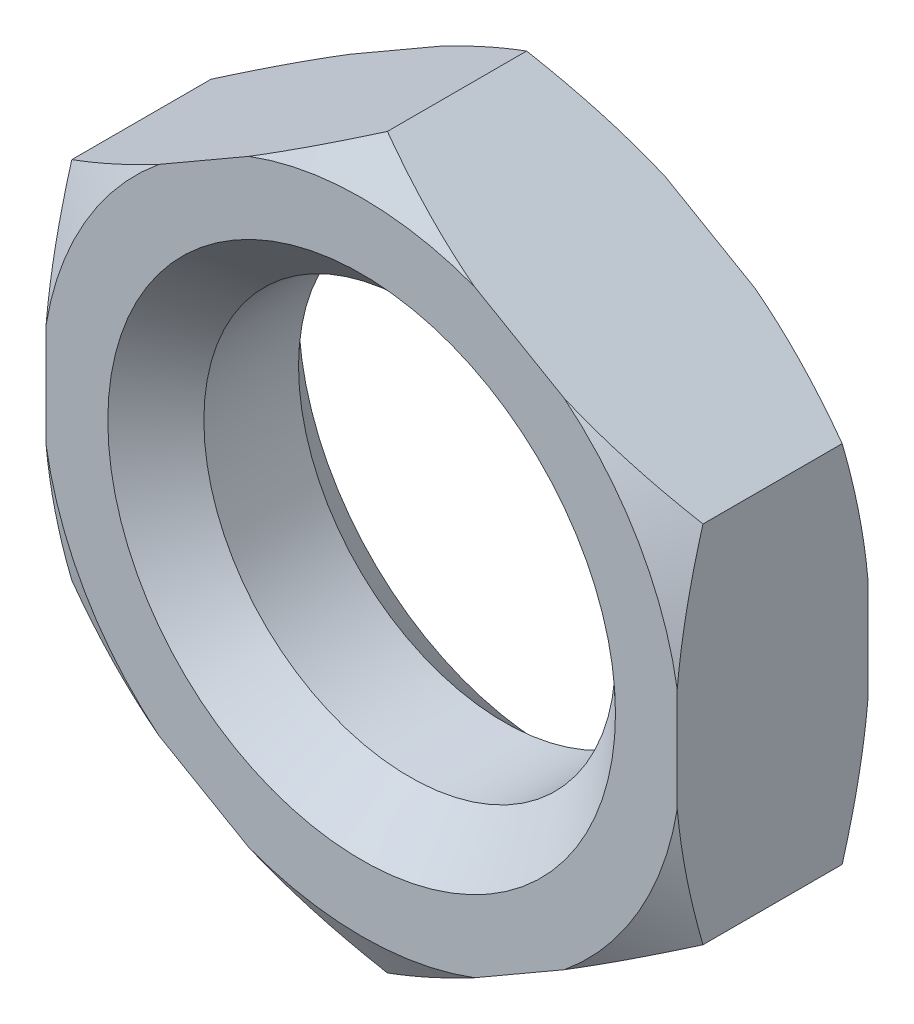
ISO-10303-21;
HEADER;
FILE_DESCRIPTION(('STEP AP214'),'2;1');
FILE_NAME('part.step','',(''),(''),'','','');
FILE_SCHEMA(('AUTOMOTIVE_DESIGN { 1 0 10303 214 1 1 1 1 }'));
ENDSEC;
DATA;
#1=APPLICATION_CONTEXT('core data for automotive mechanical design processes');
#2=APPLICATION_PROTOCOL_DEFINITION('international standard','automotive_design',2000,#1);
#3=PRODUCT_CONTEXT('',#1,'mechanical');
#4=PRODUCT('Part','Part','',(#3));
#5=PRODUCT_RELATED_PRODUCT_CATEGORY('part','',(#4));
#6=PRODUCT_DEFINITION_FORMATION('','',#4);
#7=PRODUCT_DEFINITION_CONTEXT('part definition',#1,'design');
#8=PRODUCT_DEFINITION('design','',#6,#7);
#9=PRODUCT_DEFINITION_SHAPE('','',#8);
#10=(LENGTH_UNIT() NAMED_UNIT(*) SI_UNIT(.MILLI.,.METRE.));
#11=(NAMED_UNIT(*) PLANE_ANGLE_UNIT() SI_UNIT($,.RADIAN.));
#12=(NAMED_UNIT(*) SI_UNIT($,.STERADIAN.) SOLID_ANGLE_UNIT());
#13=UNCERTAINTY_MEASURE_WITH_UNIT(LENGTH_MEASURE(1.E-05),#10,'distance_accuracy_value','');
#14=(GEOMETRIC_REPRESENTATION_CONTEXT(3) GLOBAL_UNCERTAINTY_ASSIGNED_CONTEXT((#13)) GLOBAL_UNIT_ASSIGNED_CONTEXT((#10,
#11,#12)) REPRESENTATION_CONTEXT('',''));
#15=CARTESIAN_POINT('',(0.,0.,0.));
#16=DIRECTION('',(0.,0.,1.));
#17=DIRECTION('',(1.,0.,0.));
#18=AXIS2_PLACEMENT_3D('',#15,#16,#17);
#19=CARTESIAN_POINT('',(23.,13.2790561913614,6.95));
#20=DIRECTION('',(-0.5,-0.866025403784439,0.));
#21=DIRECTION('',(0.866025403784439,-0.5,0.));
#22=AXIS2_PLACEMENT_3D('',#19,#20,#21);
#23=PLANE('',#22);
#24=CARTESIAN_POINT('',(-15.9747891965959,35.781161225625,2.21668125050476));
#25=CARTESIAN_POINT('',(-15.6134641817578,35.5725501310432,2.02166062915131));
#26=CARTESIAN_POINT('',(-15.251701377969,35.363686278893,1.82772222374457));
#27=CARTESIAN_POINT('',(-14.527223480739,34.9454087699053,1.44222167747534));
#28=CARTESIAN_POINT('',(-14.1645083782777,34.7359951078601,1.2506595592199));
#29=CARTESIAN_POINT('',(-13.0747452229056,34.1068200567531,0.679816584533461));
#30=CARTESIAN_POINT('',(-12.3461634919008,33.6861731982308,0.304424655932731));
#31=CARTESIAN_POINT('',(-10.8819184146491,32.84079090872,-0.435063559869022));
#32=CARTESIAN_POINT('',(-10.1462398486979,32.416046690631,-0.799119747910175));
#33=CARTESIAN_POINT('',(-8.66937230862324,31.5633768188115,-1.51198285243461));
#34=CARTESIAN_POINT('',(-7.92818351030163,31.1354512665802,-1.86079025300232));
#35=CARTESIAN_POINT('',(-6.42047462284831,30.2649751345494,-2.54844753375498));
#36=CARTESIAN_POINT('',(-5.65378988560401,29.8223294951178,-2.8868181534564));
#37=CARTESIAN_POINT('',(-4.11268042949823,28.9325695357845,-3.53946691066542));
#38=CARTESIAN_POINT('',(-3.33825533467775,28.4854549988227,-3.85374387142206));
#39=CARTESIAN_POINT('',(-1.7815201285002,27.5866735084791,-4.45222036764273));
#40=CARTESIAN_POINT('',(-0.999218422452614,27.135011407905,-4.73644887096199));
#41=CARTESIAN_POINT('',(0.574675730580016,26.2263231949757,-5.26828511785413));
#42=CARTESIAN_POINT('',(1.36626696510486,25.7692977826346,-5.51589758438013));
#43=CARTESIAN_POINT('',(2.71080604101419,24.9930277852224,-5.89635562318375));
#44=CARTESIAN_POINT('',(3.26126646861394,24.6752193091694,-6.04092236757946));
#45=CARTESIAN_POINT('',(4.36650850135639,24.0371075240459,-6.30618142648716));
#46=CARTESIAN_POINT('',(4.92129001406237,23.7168042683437,-6.42687425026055));
#47=CARTESIAN_POINT('',(6.0345812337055,23.0740452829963,-6.64165739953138));
#48=CARTESIAN_POINT('',(6.59308993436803,22.751590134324,-6.73575462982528));
#49=CARTESIAN_POINT('',(7.7132191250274,22.1048832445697,-6.89496841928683));
#50=CARTESIAN_POINT('',(8.27483958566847,21.7806315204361,-6.96008525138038));
#51=CARTESIAN_POINT('',(9.39360548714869,21.1347117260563,-7.05890104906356));
#52=CARTESIAN_POINT('',(9.95072714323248,20.813057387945,-7.09295613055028));
#53=CARTESIAN_POINT('',(11.0657460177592,20.1693009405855,-7.12992128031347));
#54=CARTESIAN_POINT('',(11.6236432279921,19.8471988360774,-7.13283167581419));
#55=CARTESIAN_POINT('',(12.7389327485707,19.203286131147,-7.10741538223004));
#56=CARTESIAN_POINT('',(13.2963250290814,18.8814755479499,-7.07908695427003));
#57=CARTESIAN_POINT('',(14.4093162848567,18.2388897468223,-6.99205266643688));
#58=CARTESIAN_POINT('',(14.9649152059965,17.9181145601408,-6.93334589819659));
#59=CARTESIAN_POINT('',(16.2771146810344,17.1605158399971,-6.76030661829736));
#60=CARTESIAN_POINT('',(17.0324867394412,16.7244015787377,-6.63345679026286));
#61=CARTESIAN_POINT('',(18.5361378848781,15.8562681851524,-6.3318718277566));
#62=CARTESIAN_POINT('',(19.2844146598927,15.4242503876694,-6.15712160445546));
#63=CARTESIAN_POINT('',(20.7736014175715,14.5644680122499,-5.76635535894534));
#64=CARTESIAN_POINT('',(21.5145026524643,14.1367084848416,-5.55029534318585));
#65=CARTESIAN_POINT('',(22.9879614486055,13.2860066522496,-5.08371928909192));
#66=CARTESIAN_POINT('',(23.7205198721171,12.8630638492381,-4.83320684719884));
#67=CARTESIAN_POINT('',(25.1865297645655,12.0166626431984,-4.30050934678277));
#68=CARTESIAN_POINT('',(25.9198870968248,11.5932585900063,-4.01798126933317));
#69=CARTESIAN_POINT('',(27.3788320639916,10.7509363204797,-3.42917616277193));
#70=CARTESIAN_POINT('',(28.1044244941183,10.3320153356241,-3.12291488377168));
#71=CARTESIAN_POINT('',(29.5489532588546,9.49801626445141,-2.49087030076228));
#72=CARTESIAN_POINT('',(30.2678913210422,9.08293718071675,-2.16509223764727));
#73=CARTESIAN_POINT('',(31.7002116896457,8.25598663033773,-1.49737747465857));
#74=CARTESIAN_POINT('',(32.413593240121,7.84411560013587,-1.15543861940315));
#75=CARTESIAN_POINT('',(33.6187984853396,7.14829002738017,-0.564461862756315));
#76=CARTESIAN_POINT('',(34.111893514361,6.86360147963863,-0.31886634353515));
#77=CARTESIAN_POINT('',(35.0959178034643,6.29547479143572,0.177991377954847));
#78=CARTESIAN_POINT('',(35.586847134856,6.01203660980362,0.42925339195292));
#79=CARTESIAN_POINT('',(36.5615831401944,5.44927251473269,0.934092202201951));
#80=CARTESIAN_POINT('',(37.0454102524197,5.16993480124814,1.18761646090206));
#81=CARTESIAN_POINT('',(38.0113463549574,4.61225133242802,1.69901946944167));
#82=CARTESIAN_POINT('',(38.4934553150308,4.33390559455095,1.9568982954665));
#83=CARTESIAN_POINT('',(38.9747891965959,4.05600734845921,2.21668125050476));
#84=B_SPLINE_CURVE_WITH_KNOTS('',3,(#24,#25,#26,#27,#28,#29,#30,#31,#32,#33,#34,#35,#36,#37,#38,
#39,#40,#41,#42,#43,#44,#45,#46,#47,#48,#49,#50,#51,#52,#53,#54,#55,#56,#57,#58,#59,#60,#61,#62,
#63,#64,#65,#66,#67,#68,#69,#70,#71,#72,#73,#74,#75,#76,#77,#78,#79,#80,#81,#82,#83),
.UNSPECIFIED.,.F.,.F.,(4,2,2,2,2,2,2,2,2,2,2,2,2,2,2,2,2,2,2,2,2,2,2,2,2,2,2,2,2,4),(0.,
1.38165067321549,2.76331448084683,5.52696407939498,8.29947936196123,11.0719065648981,
13.9148838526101,16.7579999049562,19.5983496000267,22.4383326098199,24.3934941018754,
26.3486138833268,28.3032256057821,30.2578189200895,32.1897107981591,34.1215823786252,
36.0535615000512,37.9855983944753,40.628212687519,43.2716603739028,45.9179390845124,
48.5639417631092,51.2415955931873,53.9174874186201,56.5926638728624,59.2681981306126,
61.1284279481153,62.9885960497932,64.8291026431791,66.6696414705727),.UNSPECIFIED.);
#85=CARTESIAN_POINT('',(0.,26.5581123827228,-5.07361162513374));
#86=VERTEX_POINT('',#85);
#87=CARTESIAN_POINT('',(8.22874991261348,21.8072414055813,-6.95));
#88=VERTEX_POINT('',#87);
#89=EDGE_CURVE('E177',#86,#88,#84,.T.);
#90=ORIENTED_EDGE('',*,*,#89,.F.);
#91=DIRECTION('',(0.,0.,-1.));
#92=VECTOR('',#91,1.);
#93=CARTESIAN_POINT('',(0.,26.5581123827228,6.95));
#94=LINE('',#93,#92);
#95=CARTESIAN_POINT('',(0.,26.5581123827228,5.07361162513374));
#96=VERTEX_POINT('',#95);
#97=EDGE_CURVE('E222',#96,#86,#94,.T.);
#98=ORIENTED_EDGE('',*,*,#97,.F.);
#99=CARTESIAN_POINT('',(38.9747891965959,4.0560073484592,-2.21668125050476));
#100=CARTESIAN_POINT('',(38.6134641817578,4.26461844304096,-2.0216606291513));
#101=CARTESIAN_POINT('',(38.251701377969,4.4734822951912,-1.82772222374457));
#102=CARTESIAN_POINT('',(37.527223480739,4.89175980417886,-1.44222167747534));
#103=CARTESIAN_POINT('',(37.1645083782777,5.10117346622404,-1.2506595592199));
#104=CARTESIAN_POINT('',(36.0747452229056,5.73034851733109,-0.679816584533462));
#105=CARTESIAN_POINT('',(35.3461634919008,6.15099537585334,-0.30442465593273));
#106=CARTESIAN_POINT('',(33.8819184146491,6.9963776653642,0.435063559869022));
#107=CARTESIAN_POINT('',(33.1462398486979,7.42112188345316,0.799119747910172));
#108=CARTESIAN_POINT('',(31.6693723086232,8.27379175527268,1.51198285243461));
#109=CARTESIAN_POINT('',(30.9281835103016,8.701717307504,1.86079025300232));
#110=CARTESIAN_POINT('',(29.4204746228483,9.57219343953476,2.54844753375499));
#111=CARTESIAN_POINT('',(28.653789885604,10.0148390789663,2.8868181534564));
#112=CARTESIAN_POINT('',(27.1126804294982,10.9045990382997,3.53946691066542));
#113=CARTESIAN_POINT('',(26.3382553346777,11.3517135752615,3.85374387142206));
#114=CARTESIAN_POINT('',(24.7815201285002,12.2504950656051,4.45222036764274));
#115=CARTESIAN_POINT('',(23.9992184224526,12.7021571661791,4.73644887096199));
#116=CARTESIAN_POINT('',(22.42532426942,13.6108453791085,5.26828511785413));
#117=CARTESIAN_POINT('',(21.6337330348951,14.0678707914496,5.51589758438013));
#118=CARTESIAN_POINT('',(20.2891939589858,14.8441407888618,5.89635562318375));
#119=CARTESIAN_POINT('',(19.7387335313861,15.1619492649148,6.04092236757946));
#120=CARTESIAN_POINT('',(18.6334914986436,15.8000610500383,6.30618142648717));
#121=CARTESIAN_POINT('',(18.0787099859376,16.1203643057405,6.42687425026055));
#122=CARTESIAN_POINT('',(16.9654187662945,16.7631232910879,6.64165739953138));
#123=CARTESIAN_POINT('',(16.406910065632,17.0855784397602,6.73575462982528));
#124=CARTESIAN_POINT('',(15.2867808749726,17.7322853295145,6.89496841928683));
#125=CARTESIAN_POINT('',(14.7251604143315,18.0565370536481,6.96008525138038));
#126=CARTESIAN_POINT('',(13.6063945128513,18.7024568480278,7.05890104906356));
#127=CARTESIAN_POINT('',(13.0492728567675,19.0241111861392,7.09295613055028));
#128=CARTESIAN_POINT('',(11.9342539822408,19.6678676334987,7.12992128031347));
#129=CARTESIAN_POINT('',(11.3763567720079,19.9899697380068,7.13283167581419));
#130=CARTESIAN_POINT('',(10.2610672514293,20.6338824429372,7.10741538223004));
#131=CARTESIAN_POINT('',(9.70367497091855,20.9556930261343,7.07908695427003));
#132=CARTESIAN_POINT('',(8.59068371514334,21.5982788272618,6.99205266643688));
#133=CARTESIAN_POINT('',(8.03508479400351,21.9190540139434,6.93334589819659));
#134=CARTESIAN_POINT('',(6.72288531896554,22.676652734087,6.76030661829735));
#135=CARTESIAN_POINT('',(5.96751326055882,23.1127669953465,6.63345679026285));
#136=CARTESIAN_POINT('',(4.46386211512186,23.9809003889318,6.3318718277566));
#137=CARTESIAN_POINT('',(3.71558534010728,24.4129181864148,6.15712160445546));
#138=CARTESIAN_POINT('',(2.22639858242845,25.2727005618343,5.76635535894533));
#139=CARTESIAN_POINT('',(1.48549734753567,25.7004600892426,5.55029534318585));
#140=CARTESIAN_POINT('',(0.0120385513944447,26.5511619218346,5.08371928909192));
#141=CARTESIAN_POINT('',(-0.720519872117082,26.9741047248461,4.83320684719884));
#142=CARTESIAN_POINT('',(-2.18652976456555,27.8205059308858,4.30050934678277));
#143=CARTESIAN_POINT('',(-2.91988709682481,28.2439099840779,4.01798126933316));
#144=CARTESIAN_POINT('',(-4.37883206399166,29.0862322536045,3.42917616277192));
#145=CARTESIAN_POINT('',(-5.10442449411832,29.5051532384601,3.12291488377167));
#146=CARTESIAN_POINT('',(-6.54895325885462,30.3391523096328,2.49087030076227));
#147=CARTESIAN_POINT('',(-7.2678913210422,30.7542313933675,2.16509223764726));
#148=CARTESIAN_POINT('',(-8.70021168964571,31.5811819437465,1.49737747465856));
#149=CARTESIAN_POINT('',(-9.41359324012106,31.9930529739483,1.15543861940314));
#150=CARTESIAN_POINT('',(-10.6187984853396,32.688878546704,0.5644618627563));
#151=CARTESIAN_POINT('',(-11.111893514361,32.9735670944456,0.318866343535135));
#152=CARTESIAN_POINT('',(-12.0959178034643,33.5416937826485,-0.177991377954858));
#153=CARTESIAN_POINT('',(-12.586847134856,33.8251319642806,-0.429253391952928));
#154=CARTESIAN_POINT('',(-13.5615831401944,34.3878960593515,-0.93409220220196));
#155=CARTESIAN_POINT('',(-14.0454102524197,34.6672337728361,-1.18761646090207));
#156=CARTESIAN_POINT('',(-15.0113463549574,35.2249172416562,-1.69901946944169));
#157=CARTESIAN_POINT('',(-15.4934553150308,35.5032629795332,-1.95689829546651));
#158=CARTESIAN_POINT('',(-15.9747891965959,35.781161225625,-2.21668125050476));
#159=B_SPLINE_CURVE_WITH_KNOTS('',3,(#99,#100,#101,#102,#103,#104,#105,#106,#107,#108,#109,#110,
#111,#112,#113,#114,#115,#116,#117,#118,#119,#120,#121,#122,#123,#124,#125,#126,#127,#128,#129,
#130,#131,#132,#133,#134,#135,#136,#137,#138,#139,#140,#141,#142,#143,#144,#145,#146,#147,#148,
#149,#150,#151,#152,#153,#154,#155,#156,#157,#158),.UNSPECIFIED.,.F.,.F.,(4,2,2,2,2,2,2,2,2,2,2,
2,2,2,2,2,2,2,2,2,2,2,2,2,2,2,2,2,2,4),(0.,1.38165067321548,2.76331448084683,5.52696407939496,
8.29947936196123,11.0719065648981,13.9148838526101,16.7579999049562,19.5983496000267,
22.4383326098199,24.3934941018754,26.3486138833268,28.3032256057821,30.2578189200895,
32.1897107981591,34.1215823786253,36.0535615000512,37.9855983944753,40.628212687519,
43.2716603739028,45.9179390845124,48.5639417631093,51.2415955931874,53.9174874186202,
56.5926638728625,59.2681981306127,61.1284279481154,62.9885960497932,64.8291026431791,
66.6696414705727),.UNSPECIFIED.);
#160=CARTESIAN_POINT('',(8.22874991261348,21.8072414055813,6.95));
#161=VERTEX_POINT('',#160);
#162=EDGE_CURVE('E372',#161,#96,#159,.T.);
#163=ORIENTED_EDGE('',*,*,#162,.F.);
#164=DIRECTION('',(-0.866025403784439,0.5,0.));
#165=VECTOR('',#164,1.);
#166=CARTESIAN_POINT('',(23.,13.2790561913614,6.95));
#167=LINE('',#166,#165);
#168=CARTESIAN_POINT('',(14.7712500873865,18.0299271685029,6.95));
#169=VERTEX_POINT('',#168);
#170=EDGE_CURVE('E350',#169,#161,#167,.T.);
#171=ORIENTED_EDGE('',*,*,#170,.F.);
#172=CARTESIAN_POINT('',(23.,13.2790561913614,5.07361162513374));
#173=VERTEX_POINT('',#172);
#174=EDGE_CURVE('E194',#173,#169,#159,.T.);
#175=ORIENTED_EDGE('',*,*,#174,.F.);
#176=DIRECTION('',(0.,0.,-1.));
#177=VECTOR('',#176,1.);
#178=CARTESIAN_POINT('',(23.,13.2790561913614,6.95));
#179=LINE('',#178,#177);
#180=CARTESIAN_POINT('',(23.,13.2790561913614,-5.07361162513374));
#181=VERTEX_POINT('',#180);
#182=EDGE_CURVE('E183',#173,#181,#179,.T.);
#183=ORIENTED_EDGE('',*,*,#182,.T.);
#184=CARTESIAN_POINT('',(14.7712500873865,18.0299271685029,-6.95));
#185=VERTEX_POINT('',#184);
#186=EDGE_CURVE('E164',#185,#181,#84,.T.);
#187=ORIENTED_EDGE('',*,*,#186,.F.);
#188=DIRECTION('',(-0.866025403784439,0.5,0.));
#189=VECTOR('',#188,1.);
#190=CARTESIAN_POINT('',(23.,13.2790561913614,-6.95));
#191=LINE('',#190,#189);
#192=EDGE_CURVE('E264',#185,#88,#191,.T.);
#193=ORIENTED_EDGE('',*,*,#192,.T.);
#194=EDGE_LOOP('',(#90,#98,#163,#171,#175,#183,#187,#193));
#195=FACE_BOUND('',#194,.T.);
#196=ADVANCED_FACE('F39',(#195),#23,.F.);
#197=CARTESIAN_POINT('',(0.,26.5581123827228,6.95));
#198=DIRECTION('',(0.5,-0.866025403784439,0.));
#199=DIRECTION('',(0.866025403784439,0.5,0.));
#200=AXIS2_PLACEMENT_3D('',#197,#198,#199);
#201=PLANE('',#200);
#202=CARTESIAN_POINT('',(-38.9747891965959,4.05600734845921,2.21668125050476));
#203=CARTESIAN_POINT('',(-38.6134641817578,4.26461844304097,2.02166062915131));
#204=CARTESIAN_POINT('',(-38.251701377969,4.47348229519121,1.82772222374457));
#205=CARTESIAN_POINT('',(-37.527223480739,4.89175980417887,1.44222167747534));
#206=CARTESIAN_POINT('',(-37.1645083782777,5.10117346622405,1.2506595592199));
#207=CARTESIAN_POINT('',(-36.0747452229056,5.7303485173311,0.679816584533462));
#208=CARTESIAN_POINT('',(-35.3461634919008,6.15099537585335,0.304424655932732));
#209=CARTESIAN_POINT('',(-33.8819184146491,6.9963776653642,-0.435063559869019));
#210=CARTESIAN_POINT('',(-33.1462398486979,7.42112188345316,-0.799119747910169));
#211=CARTESIAN_POINT('',(-31.6693723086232,8.27379175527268,-1.5119828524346));
#212=CARTESIAN_POINT('',(-30.9281835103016,8.701717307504,-1.86079025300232));
#213=CARTESIAN_POINT('',(-29.4204746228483,9.57219343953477,-2.54844753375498));
#214=CARTESIAN_POINT('',(-28.653789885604,10.0148390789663,-2.88681815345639));
#215=CARTESIAN_POINT('',(-27.1126804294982,10.9045990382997,-3.53946691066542));
#216=CARTESIAN_POINT('',(-26.3382553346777,11.3517135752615,-3.85374387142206));
#217=CARTESIAN_POINT('',(-24.7815201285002,12.2504950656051,-4.45222036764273));
#218=CARTESIAN_POINT('',(-23.9992184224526,12.7021571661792,-4.73644887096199));
#219=CARTESIAN_POINT('',(-22.42532426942,13.6108453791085,-5.26828511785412));
#220=CARTESIAN_POINT('',(-21.6337330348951,14.0678707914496,-5.51589758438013));
#221=CARTESIAN_POINT('',(-20.2891939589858,14.8441407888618,-5.89635562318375));
#222=CARTESIAN_POINT('',(-19.7387335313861,15.1619492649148,-6.04092236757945));
#223=CARTESIAN_POINT('',(-18.6334914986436,15.8000610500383,-6.30618142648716));
#224=CARTESIAN_POINT('',(-18.0787099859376,16.1203643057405,-6.42687425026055));
#225=CARTESIAN_POINT('',(-16.9654187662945,16.7631232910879,-6.64165739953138));
#226=CARTESIAN_POINT('',(-16.406910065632,17.0855784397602,-6.73575462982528));
#227=CARTESIAN_POINT('',(-15.2867808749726,17.7322853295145,-6.89496841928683));
#228=CARTESIAN_POINT('',(-14.7251604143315,18.0565370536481,-6.96008525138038));
#229=CARTESIAN_POINT('',(-13.6063945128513,18.7024568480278,-7.05890104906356));
#230=CARTESIAN_POINT('',(-13.0492728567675,19.0241111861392,-7.09295613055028));
#231=CARTESIAN_POINT('',(-11.9342539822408,19.6678676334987,-7.12992128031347));
#232=CARTESIAN_POINT('',(-11.3763567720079,19.9899697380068,-7.13283167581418));
#233=CARTESIAN_POINT('',(-10.2610672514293,20.6338824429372,-7.10741538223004));
#234=CARTESIAN_POINT('',(-9.70367497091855,20.9556930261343,-7.07908695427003));
#235=CARTESIAN_POINT('',(-8.59068371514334,21.5982788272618,-6.99205266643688));
#236=CARTESIAN_POINT('',(-8.03508479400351,21.9190540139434,-6.93334589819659));
#237=CARTESIAN_POINT('',(-6.72288531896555,22.676652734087,-6.76030661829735));
#238=CARTESIAN_POINT('',(-5.96751326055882,23.1127669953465,-6.63345679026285));
#239=CARTESIAN_POINT('',(-4.46386211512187,23.9809003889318,-6.3318718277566));
#240=CARTESIAN_POINT('',(-3.71558534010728,24.4129181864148,-6.15712160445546));
#241=CARTESIAN_POINT('',(-2.22639858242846,25.2727005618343,-5.76635535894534));
#242=CARTESIAN_POINT('',(-1.48549734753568,25.7004600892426,-5.55029534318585));
#243=CARTESIAN_POINT('',(-0.0120385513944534,26.5511619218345,-5.08371928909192));
#244=CARTESIAN_POINT('',(0.720519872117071,26.9741047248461,-4.83320684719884));
#245=CARTESIAN_POINT('',(2.18652976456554,27.8205059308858,-4.30050934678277));
#246=CARTESIAN_POINT('',(2.91988709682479,28.2439099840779,-4.01798126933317));
#247=CARTESIAN_POINT('',(4.37883206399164,29.0862322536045,-3.42917616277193));
#248=CARTESIAN_POINT('',(5.10442449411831,29.5051532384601,-3.12291488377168));
#249=CARTESIAN_POINT('',(6.54895325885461,30.3391523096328,-2.49087030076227));
#250=CARTESIAN_POINT('',(7.26789132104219,30.7542313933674,-2.16509223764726));
#251=CARTESIAN_POINT('',(8.7002116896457,31.5811819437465,-1.49737747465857));
#252=CARTESIAN_POINT('',(9.41359324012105,31.9930529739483,-1.15543861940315));
#253=CARTESIAN_POINT('',(10.6187984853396,32.688878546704,-0.564461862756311));
#254=CARTESIAN_POINT('',(11.111893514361,32.9735670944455,-0.318866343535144));
#255=CARTESIAN_POINT('',(12.0959178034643,33.5416937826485,0.177991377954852));
#256=CARTESIAN_POINT('',(12.586847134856,33.8251319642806,0.429253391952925));
#257=CARTESIAN_POINT('',(13.5615831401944,34.3878960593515,0.934092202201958));
#258=CARTESIAN_POINT('',(14.0454102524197,34.667233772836,1.18761646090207));
#259=CARTESIAN_POINT('',(15.0113463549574,35.2249172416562,1.69901946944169));
#260=CARTESIAN_POINT('',(15.4934553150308,35.5032629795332,1.9568982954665));
#261=CARTESIAN_POINT('',(15.9747891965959,35.781161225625,2.21668125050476));
#262=B_SPLINE_CURVE_WITH_KNOTS('',3,(#202,#203,#204,#205,#206,#207,#208,#209,#210,#211,#212,
#213,#214,#215,#216,#217,#218,#219,#220,#221,#222,#223,#224,#225,#226,#227,#228,#229,#230,#231,
#232,#233,#234,#235,#236,#237,#238,#239,#240,#241,#242,#243,#244,#245,#246,#247,#248,#249,#250,
#251,#252,#253,#254,#255,#256,#257,#258,#259,#260,#261),.UNSPECIFIED.,.F.,.F.,(4,2,2,2,2,2,2,2,
2,2,2,2,2,2,2,2,2,2,2,2,2,2,2,2,2,2,2,2,2,4),(0.,1.38165067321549,2.76331448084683,
5.52696407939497,8.29947936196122,11.0719065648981,13.9148838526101,16.7579999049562,
19.5983496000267,22.4383326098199,24.3934941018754,26.3486138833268,28.3032256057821,
30.2578189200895,32.1897107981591,34.1215823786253,36.0535615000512,37.9855983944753,
40.628212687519,43.2716603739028,45.9179390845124,48.5639417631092,51.2415955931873,
53.9174874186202,56.5926638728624,59.2681981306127,61.1284279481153,62.9885960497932,
64.8291026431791,66.6696414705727),.UNSPECIFIED.);
#263=CARTESIAN_POINT('',(-23.,13.2790561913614,-5.07361162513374));
#264=VERTEX_POINT('',#263);
#265=CARTESIAN_POINT('',(-14.7712500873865,18.0299271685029,-6.95));
#266=VERTEX_POINT('',#265);
#267=EDGE_CURVE('E55',#264,#266,#262,.T.);
#268=ORIENTED_EDGE('',*,*,#267,.F.);
#269=DIRECTION('',(0.,0.,-1.));
#270=VECTOR('',#269,1.);
#271=CARTESIAN_POINT('',(-23.,13.2790561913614,6.95));
#272=LINE('',#271,#270);
#273=CARTESIAN_POINT('',(-23.,13.2790561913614,5.07361162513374));
#274=VERTEX_POINT('',#273);
#275=EDGE_CURVE('E218',#274,#264,#272,.T.);
#276=ORIENTED_EDGE('',*,*,#275,.F.);
#277=CARTESIAN_POINT('',(15.9747891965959,35.781161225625,-2.21668125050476));
#278=CARTESIAN_POINT('',(15.6134641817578,35.5725501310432,-2.0216606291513));
#279=CARTESIAN_POINT('',(15.251701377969,35.363686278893,-1.82772222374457));
#280=CARTESIAN_POINT('',(14.527223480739,34.9454087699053,-1.44222167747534));
#281=CARTESIAN_POINT('',(14.1645083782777,34.7359951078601,-1.2506595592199));
#282=CARTESIAN_POINT('',(13.0747452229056,34.1068200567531,-0.679816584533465));
#283=CARTESIAN_POINT('',(12.3461634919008,33.6861731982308,-0.304424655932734));
#284=CARTESIAN_POINT('',(10.8819184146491,32.84079090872,0.435063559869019));
#285=CARTESIAN_POINT('',(10.1462398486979,32.416046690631,0.799119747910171));
#286=CARTESIAN_POINT('',(8.66937230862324,31.5633768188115,1.5119828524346));
#287=CARTESIAN_POINT('',(7.92818351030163,31.1354512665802,1.86079025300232));
#288=CARTESIAN_POINT('',(6.42047462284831,30.2649751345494,2.54844753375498));
#289=CARTESIAN_POINT('',(5.65378988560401,29.8223294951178,2.8868181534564));
#290=CARTESIAN_POINT('',(4.11268042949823,28.9325695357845,3.53946691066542));
#291=CARTESIAN_POINT('',(3.33825533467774,28.4854549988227,3.85374387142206));
#292=CARTESIAN_POINT('',(1.78152012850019,27.5866735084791,4.45222036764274));
#293=CARTESIAN_POINT('',(0.999218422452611,27.135011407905,4.73644887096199));
#294=CARTESIAN_POINT('',(-0.574675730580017,26.2263231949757,5.26828511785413));
#295=CARTESIAN_POINT('',(-1.36626696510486,25.7692977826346,5.51589758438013));
#296=CARTESIAN_POINT('',(-2.71080604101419,24.9930277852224,5.89635562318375));
#297=CARTESIAN_POINT('',(-3.26126646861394,24.6752193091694,6.04092236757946));
#298=CARTESIAN_POINT('',(-4.3665085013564,24.0371075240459,6.30618142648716));
#299=CARTESIAN_POINT('',(-4.92129001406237,23.7168042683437,6.42687425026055));
#300=CARTESIAN_POINT('',(-6.03458123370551,23.0740452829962,6.64165739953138));
#301=CARTESIAN_POINT('',(-6.59308993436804,22.751590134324,6.73575462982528));
#302=CARTESIAN_POINT('',(-7.71321912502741,22.1048832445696,6.89496841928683));
#303=CARTESIAN_POINT('',(-8.27483958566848,21.7806315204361,6.96008525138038));
#304=CARTESIAN_POINT('',(-9.39360548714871,21.1347117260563,7.05890104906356));
#305=CARTESIAN_POINT('',(-9.9507271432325,20.813057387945,7.09295613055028));
#306=CARTESIAN_POINT('',(-11.0657460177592,20.1693009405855,7.12992128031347));
#307=CARTESIAN_POINT('',(-11.6236432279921,19.8471988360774,7.13283167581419));
#308=CARTESIAN_POINT('',(-12.7389327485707,19.203286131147,7.10741538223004));
#309=CARTESIAN_POINT('',(-13.2963250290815,18.8814755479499,7.07908695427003));
#310=CARTESIAN_POINT('',(-14.4093162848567,18.2388897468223,6.99205266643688));
#311=CARTESIAN_POINT('',(-14.9649152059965,17.9181145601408,6.93334589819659));
#312=CARTESIAN_POINT('',(-16.2771146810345,17.1605158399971,6.76030661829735));
#313=CARTESIAN_POINT('',(-17.0324867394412,16.7244015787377,6.63345679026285));
#314=CARTESIAN_POINT('',(-18.5361378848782,15.8562681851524,6.3318718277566));
#315=CARTESIAN_POINT('',(-19.2844146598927,15.4242503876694,6.15712160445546));
#316=CARTESIAN_POINT('',(-20.7736014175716,14.5644680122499,5.76635535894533));
#317=CARTESIAN_POINT('',(-21.5145026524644,14.1367084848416,5.55029534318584));
#318=CARTESIAN_POINT('',(-22.9879614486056,13.2860066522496,5.08371928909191));
#319=CARTESIAN_POINT('',(-23.7205198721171,12.8630638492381,4.83320684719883));
#320=CARTESIAN_POINT('',(-25.1865297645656,12.0166626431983,4.30050934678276));
#321=CARTESIAN_POINT('',(-25.9198870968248,11.5932585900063,4.01798126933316));
#322=CARTESIAN_POINT('',(-27.3788320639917,10.7509363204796,3.42917616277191));
#323=CARTESIAN_POINT('',(-28.1044244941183,10.3320153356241,3.12291488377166));
#324=CARTESIAN_POINT('',(-29.5489532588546,9.4980162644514,2.49087030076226));
#325=CARTESIAN_POINT('',(-30.2678913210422,9.08293718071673,2.16509223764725));
#326=CARTESIAN_POINT('',(-31.7002116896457,8.25598663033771,1.49737747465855));
#327=CARTESIAN_POINT('',(-32.4135932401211,7.84411560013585,1.15543861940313));
#328=CARTESIAN_POINT('',(-33.6187984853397,7.14829002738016,0.564461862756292));
#329=CARTESIAN_POINT('',(-34.111893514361,6.86360147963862,0.318866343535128));
#330=CARTESIAN_POINT('',(-35.0959178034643,6.29547479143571,-0.177991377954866));
#331=CARTESIAN_POINT('',(-35.586847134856,6.01203660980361,-0.429253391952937));
#332=CARTESIAN_POINT('',(-36.5615831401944,5.44927251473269,-0.934092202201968));
#333=CARTESIAN_POINT('',(-37.0454102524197,5.16993480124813,-1.18761646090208));
#334=CARTESIAN_POINT('',(-38.0113463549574,4.61225133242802,-1.69901946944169));
#335=CARTESIAN_POINT('',(-38.4934553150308,4.33390559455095,-1.95689829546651));
#336=CARTESIAN_POINT('',(-38.9747891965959,4.05600734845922,-2.21668125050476));
#337=B_SPLINE_CURVE_WITH_KNOTS('',3,(#277,#278,#279,#280,#281,#282,#283,#284,#285,#286,#287,
#288,#289,#290,#291,#292,#293,#294,#295,#296,#297,#298,#299,#300,#301,#302,#303,#304,#305,#306,
#307,#308,#309,#310,#311,#312,#313,#314,#315,#316,#317,#318,#319,#320,#321,#322,#323,#324,#325,
#326,#327,#328,#329,#330,#331,#332,#333,#334,#335,#336),.UNSPECIFIED.,.F.,.F.,(4,2,2,2,2,2,2,2,
2,2,2,2,2,2,2,2,2,2,2,2,2,2,2,2,2,2,2,2,2,4),(0.,1.38165067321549,2.76331448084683,
5.52696407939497,8.29947936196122,11.0719065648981,13.9148838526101,16.7579999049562,
19.5983496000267,22.4383326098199,24.3934941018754,26.3486138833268,28.3032256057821,
30.2578189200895,32.1897107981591,34.1215823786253,36.0535615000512,37.9855983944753,
40.628212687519,43.2716603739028,45.9179390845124,48.5639417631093,51.2415955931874,
53.9174874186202,56.5926638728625,59.2681981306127,61.1284279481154,62.9885960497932,
64.8291026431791,66.6696414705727),.UNSPECIFIED.);
#338=CARTESIAN_POINT('',(-14.7712500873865,18.0299271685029,6.95));
#339=VERTEX_POINT('',#338);
#340=EDGE_CURVE('E343',#339,#274,#337,.T.);
#341=ORIENTED_EDGE('',*,*,#340,.F.);
#342=DIRECTION('',(-0.866025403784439,-0.5,0.));
#343=VECTOR('',#342,1.);
#344=CARTESIAN_POINT('',(0.,26.5581123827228,6.95));
#345=LINE('',#344,#343);
#346=CARTESIAN_POINT('',(-8.22874991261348,21.8072414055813,6.95));
#347=VERTEX_POINT('',#346);
#348=EDGE_CURVE('E354',#347,#339,#345,.T.);
#349=ORIENTED_EDGE('',*,*,#348,.F.);
#350=EDGE_CURVE('E349',#96,#347,#337,.T.);
#351=ORIENTED_EDGE('',*,*,#350,.F.);
#352=ORIENTED_EDGE('',*,*,#97,.T.);
#353=CARTESIAN_POINT('',(-8.22874991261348,21.8072414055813,-6.95));
#354=VERTEX_POINT('',#353);
#355=EDGE_CURVE('E403',#354,#86,#262,.T.);
#356=ORIENTED_EDGE('',*,*,#355,.F.);
#357=DIRECTION('',(-0.866025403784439,-0.5,0.));
#358=VECTOR('',#357,1.);
#359=CARTESIAN_POINT('',(0.,26.5581123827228,-6.95));
#360=LINE('',#359,#358);
#361=EDGE_CURVE('E371',#354,#266,#360,.T.);
#362=ORIENTED_EDGE('',*,*,#361,.T.);
#363=EDGE_LOOP('',(#268,#276,#341,#349,#351,#352,#356,#362));
#364=FACE_BOUND('',#363,.T.);
#365=ADVANCED_FACE('F323',(#364),#201,.F.);
#366=CARTESIAN_POINT('',(-23.,13.2790561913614,6.95));
#367=DIRECTION('',(1.,0.,0.));
#368=DIRECTION('',(0.,1.,0.));
#369=AXIS2_PLACEMENT_3D('',#366,#367,#368);
#370=PLANE('',#369);
#371=CARTESIAN_POINT('',(-23.,-29.2538453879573,1.07783624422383));
#372=CARTESIAN_POINT('',(-23.,-28.8383770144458,0.889271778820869));
#373=CARTESIAN_POINT('',(-23.,-28.4223346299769,0.701973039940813));
#374=CARTESIAN_POINT('',(-23.,-27.5889998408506,0.330162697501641));
#375=CARTESIAN_POINT('',(-23.,-27.1717074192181,0.14565113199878));
#376=CARTESIAN_POINT('',(-23.,-25.917678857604,-0.403373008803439));
#377=CARTESIAN_POINT('',(-23.,-25.0789307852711,-0.763311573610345));
#378=CARTESIAN_POINT('',(-23.,-23.3917256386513,-1.46990732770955));
#379=CARTESIAN_POINT('',(-23.,-22.5432426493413,-1.81650279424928));
#380=CARTESIAN_POINT('',(-23.,-20.8391057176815,-2.49155128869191));
#381=CARTESIAN_POINT('',(-23.,-19.9834521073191,-2.82000515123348));
#382=CARTESIAN_POINT('',(-23.,-18.26775485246,-3.45330560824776));
#383=CARTESIAN_POINT('',(-23.,-17.4077478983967,-3.75825111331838));
#384=CARTESIAN_POINT('',(-23.,-15.6785423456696,-4.34120466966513));
#385=CARTESIAN_POINT('',(-23.,-14.8093432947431,-4.6192113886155));
#386=CARTESIAN_POINT('',(-23.,-13.0621643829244,-5.14192267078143));
#387=CARTESIAN_POINT('',(-23.,-12.1841976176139,-5.386670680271));
#388=CARTESIAN_POINT('',(-23.,-10.4181041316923,-5.83631948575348));
#389=CARTESIAN_POINT('',(-23.,-9.52997884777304,-6.04122584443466));
#390=CARTESIAN_POINT('',(-23.,-7.99684396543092,-6.3524042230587));
#391=CARTESIAN_POINT('',(-23.,-7.35416794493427,-6.47017859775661));
#392=CARTESIAN_POINT('',(-23.,-6.06442277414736,-6.67869986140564));
#393=CARTESIAN_POINT('',(-23.,-5.4173537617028,-6.76944759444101));
#394=CARTESIAN_POINT('',(-23.,-4.11990528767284,-6.9215165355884));
#395=CARTESIAN_POINT('',(-23.,-3.46952670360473,-6.98284517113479));
#396=CARTESIAN_POINT('',(-23.,-2.16656103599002,-7.07432917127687));
#397=CARTESIAN_POINT('',(-23.,-1.51397395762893,-7.10448460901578));
#398=CARTESIAN_POINT('',(-23.,-0.208435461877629,-7.13268181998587));
#399=CARTESIAN_POINT('',(-23.,0.444515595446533,-7.13074010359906));
#400=CARTESIAN_POINT('',(-23.,1.74952461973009,-7.0948452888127));
#401=CARTESIAN_POINT('',(-23.,2.40158259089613,-7.06089234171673));
#402=CARTESIAN_POINT('',(-23.,3.7033948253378,-6.96201184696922));
#403=CARTESIAN_POINT('',(-23.,4.35314884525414,-6.89708111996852));
#404=CARTESIAN_POINT('',(-23.,5.64906839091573,-6.73811401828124));
#405=CARTESIAN_POINT('',(-23.,6.29523376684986,-6.64407643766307));
#406=CARTESIAN_POINT('',(-23.,7.90516066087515,-6.37559106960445));
#407=CARTESIAN_POINT('',(-23.,8.86615096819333,-6.18444873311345));
#408=CARTESIAN_POINT('',(-23.,10.7766038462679,-5.75131903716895));
#409=CARTESIAN_POINT('',(-23.,11.7260638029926,-5.50932036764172));
#410=CARTESIAN_POINT('',(-23.,13.6153394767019,-4.98303311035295));
#411=CARTESIAN_POINT('',(-23.,14.5551292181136,-4.69865217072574));
#412=CARTESIAN_POINT('',(-23.,16.423628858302,-4.096058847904));
#413=CARTESIAN_POINT('',(-23.,17.3523395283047,-3.77784883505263));
#414=CARTESIAN_POINT('',(-23.,19.2105193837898,-3.11042350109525));
#415=CARTESIAN_POINT('',(-23.,20.1398751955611,-2.76089453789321));
#416=CARTESIAN_POINT('',(-23.,21.9899018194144,-2.03948813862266));
#417=CARTESIAN_POINT('',(-23.,22.9105720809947,-1.66760929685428));
#418=CARTESIAN_POINT('',(-23.,24.2830789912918,-1.09746398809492));
#419=CARTESIAN_POINT('',(-23.,24.7377529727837,-0.905980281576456));
#420=CARTESIAN_POINT('',(-23.,25.6453895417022,-0.518989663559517));
#421=CARTESIAN_POINT('',(-23.,26.0983521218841,-0.323482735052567));
#422=CARTESIAN_POINT('',(-23.,27.0025836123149,0.0711073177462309));
#423=CARTESIAN_POINT('',(-23.,27.4538529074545,0.270189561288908));
#424=CARTESIAN_POINT('',(-23.,28.3549204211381,0.671635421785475));
#425=CARTESIAN_POINT('',(-23.,28.8047186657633,0.873998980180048));
#426=CARTESIAN_POINT('',(-23.,29.2538453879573,1.07783624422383));
#427=B_SPLINE_CURVE_WITH_KNOTS('',3,(#371,#372,#373,#374,#375,#376,#377,#378,#379,#380,#381,
#382,#383,#384,#385,#386,#387,#388,#389,#390,#391,#392,#393,#394,#395,#396,#397,#398,#399,#400,
#401,#402,#403,#404,#405,#406,#407,#408,#409,#410,#411,#412,#413,#414,#415,#416,#417,#418,#419,
#420,#421,#422,#423,#424,#425,#426),.UNSPECIFIED.,.F.,.F.,(4,2,2,2,2,2,2,2,2,2,2,2,2,2,2,2,2,2,
2,2,2,2,2,2,2,2,2,4),(0.,1.36876728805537,2.73755324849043,5.47558452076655,8.22504691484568,
10.9743827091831,13.7114357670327,16.4486241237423,19.1822017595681,21.9153974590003,
23.8750329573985,25.8346072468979,27.7936865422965,29.7527612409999,31.7108282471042,
33.6688859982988,35.6271447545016,37.5854846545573,40.5231609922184,43.4614913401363,
46.4063206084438,49.3509436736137,52.3293260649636,55.3078959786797,56.7879319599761,
58.2679741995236,59.7476567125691,61.2273128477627),.UNSPECIFIED.);
#428=CARTESIAN_POINT('',(-23.,-13.2790561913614,-5.07361162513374));
#429=VERTEX_POINT('',#428);
#430=CARTESIAN_POINT('',(-23.,-3.7773142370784,-6.95));
#431=VERTEX_POINT('',#430);
#432=EDGE_CURVE('E63',#429,#431,#427,.T.);
#433=ORIENTED_EDGE('',*,*,#432,.F.);
#434=DIRECTION('',(0.,0.,-1.));
#435=VECTOR('',#434,1.);
#436=CARTESIAN_POINT('',(-23.,-13.2790561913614,6.95));
#437=LINE('',#436,#435);
#438=CARTESIAN_POINT('',(-23.,-13.2790561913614,5.07361162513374));
#439=VERTEX_POINT('',#438);
#440=EDGE_CURVE('E214',#439,#429,#437,.T.);
#441=ORIENTED_EDGE('',*,*,#440,.F.);
#442=CARTESIAN_POINT('',(-23.,29.2538453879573,-1.07783624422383));
#443=CARTESIAN_POINT('',(-23.,28.8383770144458,-0.889271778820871));
#444=CARTESIAN_POINT('',(-23.,28.4223346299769,-0.701973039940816));
#445=CARTESIAN_POINT('',(-23.,27.5889998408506,-0.330162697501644));
#446=CARTESIAN_POINT('',(-23.,27.1717074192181,-0.145651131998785));
#447=CARTESIAN_POINT('',(-23.,25.917678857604,0.403373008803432));
#448=CARTESIAN_POINT('',(-23.,25.0789307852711,0.763311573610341));
#449=CARTESIAN_POINT('',(-23.,23.3917256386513,1.46990732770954));
#450=CARTESIAN_POINT('',(-23.,22.5432426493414,1.81650279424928));
#451=CARTESIAN_POINT('',(-23.,20.8391057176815,2.49155128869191));
#452=CARTESIAN_POINT('',(-23.,19.9834521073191,2.82000515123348));
#453=CARTESIAN_POINT('',(-23.,18.2677548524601,3.45330560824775));
#454=CARTESIAN_POINT('',(-23.,17.4077478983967,3.75825111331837));
#455=CARTESIAN_POINT('',(-23.,15.6785423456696,4.34120466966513));
#456=CARTESIAN_POINT('',(-23.,14.8093432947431,4.6192113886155));
#457=CARTESIAN_POINT('',(-23.,13.0621643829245,5.14192267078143));
#458=CARTESIAN_POINT('',(-23.,12.1841976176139,5.386670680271));
#459=CARTESIAN_POINT('',(-23.,10.4181041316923,5.83631948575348));
#460=CARTESIAN_POINT('',(-23.,9.52997884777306,6.04122584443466));
#461=CARTESIAN_POINT('',(-23.,7.99684396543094,6.3524042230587));
#462=CARTESIAN_POINT('',(-23.,7.35416794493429,6.47017859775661));
#463=CARTESIAN_POINT('',(-23.,6.06442277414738,6.67869986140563));
#464=CARTESIAN_POINT('',(-23.,5.41735376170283,6.76944759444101));
#465=CARTESIAN_POINT('',(-23.,4.11990528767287,6.9215165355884));
#466=CARTESIAN_POINT('',(-23.,3.46952670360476,6.98284517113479));
#467=CARTESIAN_POINT('',(-23.,2.16656103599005,7.07432917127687));
#468=CARTESIAN_POINT('',(-23.,1.51397395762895,7.10448460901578));
#469=CARTESIAN_POINT('',(-23.,0.208435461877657,7.13268181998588));
#470=CARTESIAN_POINT('',(-23.,-0.444515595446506,7.13074010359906));
#471=CARTESIAN_POINT('',(-23.,-1.74952461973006,7.0948452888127));
#472=CARTESIAN_POINT('',(-23.,-2.4015825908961,7.06089234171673));
#473=CARTESIAN_POINT('',(-23.,-3.70339482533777,6.96201184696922));
#474=CARTESIAN_POINT('',(-23.,-4.35314884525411,6.89708111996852));
#475=CARTESIAN_POINT('',(-23.,-5.6490683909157,6.73811401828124));
#476=CARTESIAN_POINT('',(-23.,-6.29523376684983,6.64407643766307));
#477=CARTESIAN_POINT('',(-23.,-7.90516066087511,6.37559106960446));
#478=CARTESIAN_POINT('',(-23.,-8.8661509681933,6.18444873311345));
#479=CARTESIAN_POINT('',(-23.,-10.7766038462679,5.75131903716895));
#480=CARTESIAN_POINT('',(-23.,-11.7260638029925,5.50932036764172));
#481=CARTESIAN_POINT('',(-23.,-13.6153394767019,4.98303311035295));
#482=CARTESIAN_POINT('',(-23.,-14.5551292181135,4.69865217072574));
#483=CARTESIAN_POINT('',(-23.,-16.4236288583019,4.096058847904));
#484=CARTESIAN_POINT('',(-23.,-17.3523395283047,3.77784883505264));
#485=CARTESIAN_POINT('',(-23.,-19.2105193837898,3.11042350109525));
#486=CARTESIAN_POINT('',(-23.,-20.1398751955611,2.76089453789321));
#487=CARTESIAN_POINT('',(-23.,-21.9899018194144,2.03948813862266));
#488=CARTESIAN_POINT('',(-23.,-22.9105720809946,1.66760929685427));
#489=CARTESIAN_POINT('',(-23.,-24.2830789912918,1.09746398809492));
#490=CARTESIAN_POINT('',(-23.,-24.7377529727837,0.905980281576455));
#491=CARTESIAN_POINT('',(-23.,-25.6453895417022,0.518989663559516));
#492=CARTESIAN_POINT('',(-23.,-26.0983521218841,0.323482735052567));
#493=CARTESIAN_POINT('',(-23.,-27.0025836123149,-0.0711073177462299));
#494=CARTESIAN_POINT('',(-23.,-27.4538529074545,-0.270189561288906));
#495=CARTESIAN_POINT('',(-23.,-28.3549204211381,-0.671635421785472));
#496=CARTESIAN_POINT('',(-23.,-28.8047186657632,-0.873998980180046));
#497=CARTESIAN_POINT('',(-23.,-29.2538453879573,-1.07783624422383));
#498=B_SPLINE_CURVE_WITH_KNOTS('',3,(#442,#443,#444,#445,#446,#447,#448,#449,#450,#451,#452,
#453,#454,#455,#456,#457,#458,#459,#460,#461,#462,#463,#464,#465,#466,#467,#468,#469,#470,#471,
#472,#473,#474,#475,#476,#477,#478,#479,#480,#481,#482,#483,#484,#485,#486,#487,#488,#489,#490,
#491,#492,#493,#494,#495,#496,#497),.UNSPECIFIED.,.F.,.F.,(4,2,2,2,2,2,2,2,2,2,2,2,2,2,2,2,2,2,
2,2,2,2,2,2,2,2,2,4),(0.,1.36876728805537,2.73755324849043,5.47558452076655,8.22504691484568,
10.9743827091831,13.7114357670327,16.4486241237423,19.1822017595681,21.9153974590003,
23.8750329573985,25.8346072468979,27.7936865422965,29.7527612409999,31.7108282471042,
33.6688859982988,35.6271447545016,37.5854846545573,40.5231609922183,43.4614913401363,
46.4063206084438,49.3509436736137,52.3293260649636,55.3078959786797,56.7879319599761,
58.2679741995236,59.7476567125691,61.2273128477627),.UNSPECIFIED.);
#499=CARTESIAN_POINT('',(-23.,-3.7773142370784,6.95));
#500=VERTEX_POINT('',#499);
#501=EDGE_CURVE('E329',#500,#439,#498,.T.);
#502=ORIENTED_EDGE('',*,*,#501,.F.);
#503=DIRECTION('',(0.,-1.,0.));
#504=VECTOR('',#503,1.);
#505=CARTESIAN_POINT('',(-23.,13.2790561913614,6.95));
#506=LINE('',#505,#504);
#507=CARTESIAN_POINT('',(-23.,3.77731423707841,6.95));
#508=VERTEX_POINT('',#507);
#509=EDGE_CURVE('E358',#508,#500,#506,.T.);
#510=ORIENTED_EDGE('',*,*,#509,.F.);
#511=EDGE_CURVE('E336',#274,#508,#498,.T.);
#512=ORIENTED_EDGE('',*,*,#511,.F.);
#513=ORIENTED_EDGE('',*,*,#275,.T.);
#514=CARTESIAN_POINT('',(-23.,3.77731423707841,-6.95));
#515=VERTEX_POINT('',#514);
#516=EDGE_CURVE('E312',#515,#264,#427,.T.);
#517=ORIENTED_EDGE('',*,*,#516,.F.);
#518=DIRECTION('',(0.,-1.,0.));
#519=VECTOR('',#518,1.);
#520=CARTESIAN_POINT('',(-23.,13.2790561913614,-6.95));
#521=LINE('',#520,#519);
#522=EDGE_CURVE('E376',#515,#431,#521,.T.);
#523=ORIENTED_EDGE('',*,*,#522,.T.);
#524=EDGE_LOOP('',(#433,#441,#502,#510,#512,#513,#517,#523));
#525=FACE_BOUND('',#524,.T.);
#526=ADVANCED_FACE('F319',(#525),#370,.F.);
#527=CARTESIAN_POINT('',(-23.,-13.2790561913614,6.95));
#528=DIRECTION('',(0.5,0.866025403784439,0.));
#529=DIRECTION('',(-0.866025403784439,0.5,0.));
#530=AXIS2_PLACEMENT_3D('',#527,#528,#529);
#531=PLANE('',#530);
#532=CARTESIAN_POINT('',(15.9747891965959,-35.781161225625,2.21668125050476));
#533=CARTESIAN_POINT('',(15.6134641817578,-35.5725501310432,2.0216606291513));
#534=CARTESIAN_POINT('',(15.251701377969,-35.363686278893,1.82772222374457));
#535=CARTESIAN_POINT('',(14.527223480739,-34.9454087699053,1.44222167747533));
#536=CARTESIAN_POINT('',(14.1645083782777,-34.7359951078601,1.25065955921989));
#537=CARTESIAN_POINT('',(13.0747452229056,-34.1068200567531,0.67981658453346));
#538=CARTESIAN_POINT('',(12.3461634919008,-33.6861731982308,0.304424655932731));
#539=CARTESIAN_POINT('',(10.8819184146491,-32.84079090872,-0.43506355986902));
#540=CARTESIAN_POINT('',(10.1462398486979,-32.416046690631,-0.799119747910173));
#541=CARTESIAN_POINT('',(8.66937230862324,-31.5633768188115,-1.51198285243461));
#542=CARTESIAN_POINT('',(7.92818351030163,-31.1354512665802,-1.86079025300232));
#543=CARTESIAN_POINT('',(6.42047462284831,-30.2649751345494,-2.54844753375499));
#544=CARTESIAN_POINT('',(5.65378988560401,-29.8223294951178,-2.8868181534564));
#545=CARTESIAN_POINT('',(4.11268042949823,-28.9325695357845,-3.53946691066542));
#546=CARTESIAN_POINT('',(3.33825533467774,-28.4854549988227,-3.85374387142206));
#547=CARTESIAN_POINT('',(1.78152012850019,-27.5866735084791,-4.45222036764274));
#548=CARTESIAN_POINT('',(0.999218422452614,-27.135011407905,-4.73644887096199));
#549=CARTESIAN_POINT('',(-0.574675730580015,-26.2263231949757,-5.26828511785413));
#550=CARTESIAN_POINT('',(-1.36626696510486,-25.7692977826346,-5.51589758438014));
#551=CARTESIAN_POINT('',(-2.71080604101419,-24.9930277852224,-5.89635562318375));
#552=CARTESIAN_POINT('',(-3.26126646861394,-24.6752193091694,-6.04092236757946));
#553=CARTESIAN_POINT('',(-4.36650850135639,-24.0371075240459,-6.30618142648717));
#554=CARTESIAN_POINT('',(-4.92129001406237,-23.7168042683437,-6.42687425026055));
#555=CARTESIAN_POINT('',(-6.0345812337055,-23.0740452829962,-6.64165739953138));
#556=CARTESIAN_POINT('',(-6.59308993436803,-22.751590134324,-6.73575462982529));
#557=CARTESIAN_POINT('',(-7.7132191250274,-22.1048832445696,-6.89496841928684));
#558=CARTESIAN_POINT('',(-8.27483958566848,-21.7806315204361,-6.96008525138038));
#559=CARTESIAN_POINT('',(-9.3936054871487,-21.1347117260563,-7.05890104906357));
#560=CARTESIAN_POINT('',(-9.95072714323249,-20.813057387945,-7.09295613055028));
#561=CARTESIAN_POINT('',(-11.0657460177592,-20.1693009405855,-7.12992128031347));
#562=CARTESIAN_POINT('',(-11.6236432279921,-19.8471988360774,-7.13283167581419));
#563=CARTESIAN_POINT('',(-12.7389327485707,-19.203286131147,-7.10741538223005));
#564=CARTESIAN_POINT('',(-13.2963250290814,-18.8814755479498,-7.07908695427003));
#565=CARTESIAN_POINT('',(-14.4093162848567,-18.2388897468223,-6.99205266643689));
#566=CARTESIAN_POINT('',(-14.9649152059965,-17.9181145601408,-6.93334589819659));
#567=CARTESIAN_POINT('',(-16.2771146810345,-17.1605158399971,-6.76030661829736));
#568=CARTESIAN_POINT('',(-17.0324867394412,-16.7244015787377,-6.63345679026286));
#569=CARTESIAN_POINT('',(-18.5361378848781,-15.8562681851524,-6.33187182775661));
#570=CARTESIAN_POINT('',(-19.2844146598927,-15.4242503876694,-6.15712160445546));
#571=CARTESIAN_POINT('',(-20.7736014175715,-14.5644680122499,-5.76635535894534));
#572=CARTESIAN_POINT('',(-21.5145026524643,-14.1367084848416,-5.55029534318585));
#573=CARTESIAN_POINT('',(-22.9879614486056,-13.2860066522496,-5.08371928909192));
#574=CARTESIAN_POINT('',(-23.7205198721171,-12.8630638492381,-4.83320684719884));
#575=CARTESIAN_POINT('',(-25.1865297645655,-12.0166626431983,-4.30050934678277));
#576=CARTESIAN_POINT('',(-25.9198870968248,-11.5932585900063,-4.01798126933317));
#577=CARTESIAN_POINT('',(-27.3788320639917,-10.7509363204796,-3.42917616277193));
#578=CARTESIAN_POINT('',(-28.1044244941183,-10.3320153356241,-3.12291488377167));
#579=CARTESIAN_POINT('',(-29.5489532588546,-9.49801626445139,-2.49087030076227));
#580=CARTESIAN_POINT('',(-30.2678913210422,-9.08293718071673,-2.16509223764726));
#581=CARTESIAN_POINT('',(-31.7002116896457,-8.25598663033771,-1.49737747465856));
#582=CARTESIAN_POINT('',(-32.4135932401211,-7.84411560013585,-1.15543861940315));
#583=CARTESIAN_POINT('',(-33.6187984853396,-7.14829002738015,-0.564461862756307));
#584=CARTESIAN_POINT('',(-34.111893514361,-6.86360147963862,-0.318866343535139));
#585=CARTESIAN_POINT('',(-35.0959178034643,-6.2954747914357,0.177991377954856));
#586=CARTESIAN_POINT('',(-35.586847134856,-6.0120366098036,0.429253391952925));
#587=CARTESIAN_POINT('',(-36.5615831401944,-5.44927251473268,0.934092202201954));
#588=CARTESIAN_POINT('',(-37.0454102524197,-5.16993480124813,1.18761646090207));
#589=CARTESIAN_POINT('',(-38.0113463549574,-4.612251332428,1.69901946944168));
#590=CARTESIAN_POINT('',(-38.4934553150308,-4.33390559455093,1.9568982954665));
#591=CARTESIAN_POINT('',(-38.9747891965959,-4.05600734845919,2.21668125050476));
#592=B_SPLINE_CURVE_WITH_KNOTS('',3,(#532,#533,#534,#535,#536,#537,#538,#539,#540,#541,#542,
#543,#544,#545,#546,#547,#548,#549,#550,#551,#552,#553,#554,#555,#556,#557,#558,#559,#560,#561,
#562,#563,#564,#565,#566,#567,#568,#569,#570,#571,#572,#573,#574,#575,#576,#577,#578,#579,#580,
#581,#582,#583,#584,#585,#586,#587,#588,#589,#590,#591),.UNSPECIFIED.,.F.,.F.,(4,2,2,2,2,2,2,2,
2,2,2,2,2,2,2,2,2,2,2,2,2,2,2,2,2,2,2,2,2,4),(0.,1.38165067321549,2.76331448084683,
5.52696407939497,8.29947936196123,11.0719065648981,13.9148838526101,16.7579999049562,
19.5983496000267,22.4383326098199,24.3934941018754,26.3486138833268,28.3032256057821,
30.2578189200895,32.1897107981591,34.1215823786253,36.0535615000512,37.9855983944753,
40.628212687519,43.2716603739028,45.9179390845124,48.5639417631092,51.2415955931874,
53.9174874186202,56.5926638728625,59.2681981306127,61.1284279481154,62.9885960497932,
64.8291026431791,66.6696414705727),.UNSPECIFIED.);
#593=CARTESIAN_POINT('',(0.,-26.5581123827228,-5.07361162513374));
#594=VERTEX_POINT('',#593);
#595=CARTESIAN_POINT('',(-8.2287499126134,-21.8072414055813,-6.95));
#596=VERTEX_POINT('',#595);
#597=EDGE_CURVE('E302',#594,#596,#592,.T.);
#598=ORIENTED_EDGE('',*,*,#597,.F.);
#599=DIRECTION('',(0.,0.,-1.));
#600=VECTOR('',#599,1.);
#601=CARTESIAN_POINT('',(0.,-26.5581123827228,6.95));
#602=LINE('',#601,#600);
#603=CARTESIAN_POINT('',(0.,-26.5581123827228,5.07361162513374));
#604=VERTEX_POINT('',#603);
#605=EDGE_CURVE('E202',#604,#594,#602,.T.);
#606=ORIENTED_EDGE('',*,*,#605,.F.);
#607=CARTESIAN_POINT('',(-38.9747891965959,-4.05600734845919,-2.21668125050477));
#608=CARTESIAN_POINT('',(-38.6134641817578,-4.26461844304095,-2.02166062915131));
#609=CARTESIAN_POINT('',(-38.251701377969,-4.47348229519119,-1.82772222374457));
#610=CARTESIAN_POINT('',(-37.527223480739,-4.89175980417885,-1.44222167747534));
#611=CARTESIAN_POINT('',(-37.1645083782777,-5.10117346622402,-1.2506595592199));
#612=CARTESIAN_POINT('',(-36.0747452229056,-5.73034851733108,-0.679816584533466));
#613=CARTESIAN_POINT('',(-35.3461634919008,-6.15099537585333,-0.304424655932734));
#614=CARTESIAN_POINT('',(-33.8819184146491,-6.99637766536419,0.435063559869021));
#615=CARTESIAN_POINT('',(-33.1462398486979,-7.42112188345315,0.799119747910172));
#616=CARTESIAN_POINT('',(-31.6693723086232,-8.27379175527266,1.51198285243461));
#617=CARTESIAN_POINT('',(-30.9281835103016,-8.70171730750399,1.86079025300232));
#618=CARTESIAN_POINT('',(-29.4204746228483,-9.57219343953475,2.54844753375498));
#619=CARTESIAN_POINT('',(-28.653789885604,-10.0148390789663,2.8868181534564));
#620=CARTESIAN_POINT('',(-27.1126804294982,-10.9045990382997,3.53946691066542));
#621=CARTESIAN_POINT('',(-26.3382553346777,-11.3517135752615,3.85374387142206));
#622=CARTESIAN_POINT('',(-24.7815201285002,-12.2504950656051,4.45222036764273));
#623=CARTESIAN_POINT('',(-23.9992184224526,-12.7021571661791,4.73644887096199));
#624=CARTESIAN_POINT('',(-22.42532426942,-13.6108453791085,5.26828511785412));
#625=CARTESIAN_POINT('',(-21.6337330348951,-14.0678707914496,5.51589758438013));
#626=CARTESIAN_POINT('',(-20.2891939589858,-14.8441407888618,5.89635562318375));
#627=CARTESIAN_POINT('',(-19.7387335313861,-15.1619492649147,6.04092236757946));
#628=CARTESIAN_POINT('',(-18.6334914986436,-15.8000610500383,6.30618142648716));
#629=CARTESIAN_POINT('',(-18.0787099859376,-16.1203643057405,6.42687425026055));
#630=CARTESIAN_POINT('',(-16.9654187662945,-16.7631232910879,6.64165739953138));
#631=CARTESIAN_POINT('',(-16.406910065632,-17.0855784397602,6.73575462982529));
#632=CARTESIAN_POINT('',(-15.2867808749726,-17.7322853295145,6.89496841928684));
#633=CARTESIAN_POINT('',(-14.7251604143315,-18.056537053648,6.96008525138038));
#634=CARTESIAN_POINT('',(-13.6063945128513,-18.7024568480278,7.05890104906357));
#635=CARTESIAN_POINT('',(-13.0492728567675,-19.0241111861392,7.09295613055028));
#636=CARTESIAN_POINT('',(-11.9342539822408,-19.6678676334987,7.12992128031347));
#637=CARTESIAN_POINT('',(-11.3763567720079,-19.9899697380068,7.13283167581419));
#638=CARTESIAN_POINT('',(-10.2610672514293,-20.6338824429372,7.10741538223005));
#639=CARTESIAN_POINT('',(-9.70367497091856,-20.9556930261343,7.07908695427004));
#640=CARTESIAN_POINT('',(-8.59068371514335,-21.5982788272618,6.99205266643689));
#641=CARTESIAN_POINT('',(-8.03508479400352,-21.9190540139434,6.93334589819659));
#642=CARTESIAN_POINT('',(-6.72288531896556,-22.676652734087,6.76030661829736));
#643=CARTESIAN_POINT('',(-5.96751326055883,-23.1127669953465,6.63345679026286));
#644=CARTESIAN_POINT('',(-4.46386211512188,-23.9809003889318,6.33187182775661));
#645=CARTESIAN_POINT('',(-3.71558534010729,-24.4129181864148,6.15712160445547));
#646=CARTESIAN_POINT('',(-2.22639858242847,-25.2727005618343,5.76635535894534));
#647=CARTESIAN_POINT('',(-1.48549734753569,-25.7004600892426,5.55029534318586));
#648=CARTESIAN_POINT('',(-0.0120385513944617,-26.5511619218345,5.08371928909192));
#649=CARTESIAN_POINT('',(0.720519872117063,-26.974104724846,4.83320684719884));
#650=CARTESIAN_POINT('',(2.18652976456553,-27.8205059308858,4.30050934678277));
#651=CARTESIAN_POINT('',(2.91988709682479,-28.2439099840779,4.01798126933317));
#652=CARTESIAN_POINT('',(4.37883206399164,-29.0862322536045,3.42917616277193));
#653=CARTESIAN_POINT('',(5.1044244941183,-29.5051532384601,3.12291488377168));
#654=CARTESIAN_POINT('',(6.5489532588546,-30.3391523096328,2.49087030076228));
#655=CARTESIAN_POINT('',(7.26789132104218,-30.7542313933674,2.16509223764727));
#656=CARTESIAN_POINT('',(8.70021168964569,-31.5811819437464,1.49737747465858));
#657=CARTESIAN_POINT('',(9.41359324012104,-31.9930529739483,1.15543861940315));
#658=CARTESIAN_POINT('',(10.6187984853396,-32.688878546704,0.564461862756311));
#659=CARTESIAN_POINT('',(11.111893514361,-32.9735670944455,0.318866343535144));
#660=CARTESIAN_POINT('',(12.0959178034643,-33.5416937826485,-0.177991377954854));
#661=CARTESIAN_POINT('',(12.586847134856,-33.8251319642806,-0.429253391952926));
#662=CARTESIAN_POINT('',(13.5615831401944,-34.3878960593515,-0.934092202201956));
#663=CARTESIAN_POINT('',(14.0454102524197,-34.667233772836,-1.18761646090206));
#664=CARTESIAN_POINT('',(15.0113463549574,-35.2249172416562,-1.69901946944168));
#665=CARTESIAN_POINT('',(15.4934553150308,-35.5032629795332,-1.9568982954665));
#666=CARTESIAN_POINT('',(15.9747891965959,-35.781161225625,-2.21668125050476));
#667=B_SPLINE_CURVE_WITH_KNOTS('',3,(#607,#608,#609,#610,#611,#612,#613,#614,#615,#616,#617,
#618,#619,#620,#621,#622,#623,#624,#625,#626,#627,#628,#629,#630,#631,#632,#633,#634,#635,#636,
#637,#638,#639,#640,#641,#642,#643,#644,#645,#646,#647,#648,#649,#650,#651,#652,#653,#654,#655,
#656,#657,#658,#659,#660,#661,#662,#663,#664,#665,#666),.UNSPECIFIED.,.F.,.F.,(4,2,2,2,2,2,2,2,
2,2,2,2,2,2,2,2,2,2,2,2,2,2,2,2,2,2,2,2,2,4),(0.,1.38165067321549,2.76331448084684,
5.52696407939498,8.29947936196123,11.0719065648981,13.9148838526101,16.7579999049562,
19.5983496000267,22.4383326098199,24.3934941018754,26.3486138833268,28.3032256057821,
30.2578189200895,32.1897107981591,34.1215823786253,36.0535615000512,37.9855983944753,
40.628212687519,43.2716603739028,45.9179390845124,48.5639417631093,51.2415955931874,
53.9174874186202,56.5926638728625,59.2681981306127,61.1284279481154,62.9885960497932,
64.8291026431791,66.6696414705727),.UNSPECIFIED.);
#668=CARTESIAN_POINT('',(-8.2287499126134,-21.8072414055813,6.95));
#669=VERTEX_POINT('',#668);
#670=EDGE_CURVE('E338',#669,#604,#667,.T.);
#671=ORIENTED_EDGE('',*,*,#670,.F.);
#672=DIRECTION('',(0.866025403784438,-0.5,0.));
#673=VECTOR('',#672,1.);
#674=CARTESIAN_POINT('',(-23.,-13.2790561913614,6.95));
#675=LINE('',#674,#673);
#676=CARTESIAN_POINT('',(-14.7712500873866,-18.0299271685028,6.95));
#677=VERTEX_POINT('',#676);
#678=EDGE_CURVE('E362',#677,#669,#675,.T.);
#679=ORIENTED_EDGE('',*,*,#678,.F.);
#680=EDGE_CURVE('E337',#439,#677,#667,.T.);
#681=ORIENTED_EDGE('',*,*,#680,.F.);
#682=ORIENTED_EDGE('',*,*,#440,.T.);
#683=CARTESIAN_POINT('',(-14.7712500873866,-18.0299271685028,-6.95));
#684=VERTEX_POINT('',#683);
#685=EDGE_CURVE('E313',#684,#429,#592,.T.);
#686=ORIENTED_EDGE('',*,*,#685,.F.);
#687=DIRECTION('',(0.866025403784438,-0.5,0.));
#688=VECTOR('',#687,1.);
#689=CARTESIAN_POINT('',(-23.,-13.2790561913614,-6.95));
#690=LINE('',#689,#688);
#691=EDGE_CURVE('E380',#684,#596,#690,.T.);
#692=ORIENTED_EDGE('',*,*,#691,.T.);
#693=EDGE_LOOP('',(#598,#606,#671,#679,#681,#682,#686,#692));
#694=FACE_BOUND('',#693,.T.);
#695=ADVANCED_FACE('F322',(#694),#531,.F.);
#696=CARTESIAN_POINT('',(0.,-26.5581123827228,6.95));
#697=DIRECTION('',(-0.5,0.866025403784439,0.));
#698=DIRECTION('',(-0.866025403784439,-0.5,0.));
#699=AXIS2_PLACEMENT_3D('',#696,#697,#698);
#700=PLANE('',#699);
#701=CARTESIAN_POINT('',(38.9747891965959,-4.05600734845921,2.21668125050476));
#702=CARTESIAN_POINT('',(38.6134641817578,-4.26461844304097,2.0216606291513));
#703=CARTESIAN_POINT('',(38.251701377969,-4.4734822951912,1.82772222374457));
#704=CARTESIAN_POINT('',(37.527223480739,-4.89175980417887,1.44222167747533));
#705=CARTESIAN_POINT('',(37.1645083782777,-5.10117346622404,1.25065955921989));
#706=CARTESIAN_POINT('',(36.0747452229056,-5.73034851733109,0.679816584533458));
#707=CARTESIAN_POINT('',(35.3461634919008,-6.15099537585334,0.304424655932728));
#708=CARTESIAN_POINT('',(33.8819184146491,-6.9963776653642,-0.435063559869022));
#709=CARTESIAN_POINT('',(33.1462398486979,-7.42112188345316,-0.799119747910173));
#710=CARTESIAN_POINT('',(31.6693723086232,-8.27379175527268,-1.51198285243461));
#711=CARTESIAN_POINT('',(30.9281835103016,-8.701717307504,-1.86079025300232));
#712=CARTESIAN_POINT('',(29.4204746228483,-9.57219343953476,-2.54844753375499));
#713=CARTESIAN_POINT('',(28.653789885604,-10.0148390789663,-2.8868181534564));
#714=CARTESIAN_POINT('',(27.1126804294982,-10.9045990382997,-3.53946691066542));
#715=CARTESIAN_POINT('',(26.3382553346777,-11.3517135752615,-3.85374387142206));
#716=CARTESIAN_POINT('',(24.7815201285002,-12.2504950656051,-4.45222036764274));
#717=CARTESIAN_POINT('',(23.9992184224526,-12.7021571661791,-4.73644887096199));
#718=CARTESIAN_POINT('',(22.42532426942,-13.6108453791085,-5.26828511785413));
#719=CARTESIAN_POINT('',(21.6337330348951,-14.0678707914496,-5.51589758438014));
#720=CARTESIAN_POINT('',(20.2891939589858,-14.8441407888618,-5.89635562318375));
#721=CARTESIAN_POINT('',(19.7387335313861,-15.1619492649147,-6.04092236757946));
#722=CARTESIAN_POINT('',(18.6334914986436,-15.8000610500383,-6.30618142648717));
#723=CARTESIAN_POINT('',(18.0787099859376,-16.1203643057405,-6.42687425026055));
#724=CARTESIAN_POINT('',(16.9654187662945,-16.7631232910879,-6.64165739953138));
#725=CARTESIAN_POINT('',(16.406910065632,-17.0855784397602,-6.73575462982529));
#726=CARTESIAN_POINT('',(15.2867808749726,-17.7322853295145,-6.89496841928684));
#727=CARTESIAN_POINT('',(14.7251604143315,-18.0565370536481,-6.96008525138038));
#728=CARTESIAN_POINT('',(13.6063945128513,-18.7024568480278,-7.05890104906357));
#729=CARTESIAN_POINT('',(13.0492728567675,-19.0241111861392,-7.09295613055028));
#730=CARTESIAN_POINT('',(11.9342539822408,-19.6678676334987,-7.12992128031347));
#731=CARTESIAN_POINT('',(11.3763567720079,-19.9899697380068,-7.13283167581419));
#732=CARTESIAN_POINT('',(10.2610672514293,-20.6338824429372,-7.10741538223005));
#733=CARTESIAN_POINT('',(9.70367497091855,-20.9556930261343,-7.07908695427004));
#734=CARTESIAN_POINT('',(8.59068371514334,-21.5982788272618,-6.99205266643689));
#735=CARTESIAN_POINT('',(8.0350847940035,-21.9190540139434,-6.9333458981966));
#736=CARTESIAN_POINT('',(6.72288531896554,-22.676652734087,-6.76030661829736));
#737=CARTESIAN_POINT('',(5.96751326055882,-23.1127669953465,-6.63345679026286));
#738=CARTESIAN_POINT('',(4.46386211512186,-23.9809003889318,-6.33187182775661));
#739=CARTESIAN_POINT('',(3.71558534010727,-24.4129181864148,-6.15712160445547));
#740=CARTESIAN_POINT('',(2.22639858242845,-25.2727005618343,-5.76635535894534));
#741=CARTESIAN_POINT('',(1.48549734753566,-25.7004600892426,-5.55029534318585));
#742=CARTESIAN_POINT('',(0.0120385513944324,-26.5511619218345,-5.08371928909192));
#743=CARTESIAN_POINT('',(-0.720519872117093,-26.9741047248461,-4.83320684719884));
#744=CARTESIAN_POINT('',(-2.18652976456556,-27.8205059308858,-4.30050934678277));
#745=CARTESIAN_POINT('',(-2.91988709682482,-28.2439099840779,-4.01798126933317));
#746=CARTESIAN_POINT('',(-4.37883206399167,-29.0862322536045,-3.42917616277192));
#747=CARTESIAN_POINT('',(-5.10442449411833,-29.5051532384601,-3.12291488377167));
#748=CARTESIAN_POINT('',(-6.54895325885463,-30.3391523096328,-2.49087030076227));
#749=CARTESIAN_POINT('',(-7.26789132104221,-30.7542313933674,-2.16509223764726));
#750=CARTESIAN_POINT('',(-8.70021168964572,-31.5811819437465,-1.49737747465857));
#751=CARTESIAN_POINT('',(-9.41359324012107,-31.9930529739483,-1.15543861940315));
#752=CARTESIAN_POINT('',(-10.6187984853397,-32.688878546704,-0.564461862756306));
#753=CARTESIAN_POINT('',(-11.111893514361,-32.9735670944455,-0.31886634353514));
#754=CARTESIAN_POINT('',(-12.0959178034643,-33.5416937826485,0.177991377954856));
#755=CARTESIAN_POINT('',(-12.586847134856,-33.8251319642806,0.429253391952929));
#756=CARTESIAN_POINT('',(-13.5615831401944,-34.3878960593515,0.93409220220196));
#757=CARTESIAN_POINT('',(-14.0454102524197,-34.667233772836,1.18761646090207));
#758=CARTESIAN_POINT('',(-15.0113463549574,-35.2249172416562,1.69901946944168));
#759=CARTESIAN_POINT('',(-15.4934553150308,-35.5032629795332,1.9568982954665));
#760=CARTESIAN_POINT('',(-15.974789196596,-35.781161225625,2.21668125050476));
#761=B_SPLINE_CURVE_WITH_KNOTS('',3,(#701,#702,#703,#704,#705,#706,#707,#708,#709,#710,#711,
#712,#713,#714,#715,#716,#717,#718,#719,#720,#721,#722,#723,#724,#725,#726,#727,#728,#729,#730,
#731,#732,#733,#734,#735,#736,#737,#738,#739,#740,#741,#742,#743,#744,#745,#746,#747,#748,#749,
#750,#751,#752,#753,#754,#755,#756,#757,#758,#759,#760),.UNSPECIFIED.,.F.,.F.,(4,2,2,2,2,2,2,2,
2,2,2,2,2,2,2,2,2,2,2,2,2,2,2,2,2,2,2,2,2,4),(0.,1.38165067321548,2.76331448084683,
5.52696407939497,8.29947936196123,11.0719065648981,13.9148838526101,16.7579999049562,
19.5983496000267,22.4383326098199,24.3934941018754,26.3486138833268,28.3032256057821,
30.2578189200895,32.1897107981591,34.1215823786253,36.0535615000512,37.9855983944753,
40.628212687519,43.2716603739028,45.9179390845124,48.5639417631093,51.2415955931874,
53.9174874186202,56.5926638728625,59.2681981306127,61.1284279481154,62.9885960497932,
64.8291026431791,66.6696414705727),.UNSPECIFIED.);
#762=CARTESIAN_POINT('',(23.,-13.2790561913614,-5.07361162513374));
#763=VERTEX_POINT('',#762);
#764=CARTESIAN_POINT('',(14.7712500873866,-18.0299271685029,-6.95));
#765=VERTEX_POINT('',#764);
#766=EDGE_CURVE('E188',#763,#765,#761,.T.);
#767=ORIENTED_EDGE('',*,*,#766,.F.);
#768=DIRECTION('',(0.,0.,-1.));
#769=VECTOR('',#768,1.);
#770=CARTESIAN_POINT('',(23.,-13.2790561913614,6.95));
#771=LINE('',#770,#769);
#772=CARTESIAN_POINT('',(23.,-13.2790561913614,5.07361162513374));
#773=VERTEX_POINT('',#772);
#774=EDGE_CURVE('E196',#773,#763,#771,.T.);
#775=ORIENTED_EDGE('',*,*,#774,.F.);
#776=CARTESIAN_POINT('',(-15.9747891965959,-35.781161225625,-2.21668125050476));
#777=CARTESIAN_POINT('',(-15.6134641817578,-35.5725501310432,-2.0216606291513));
#778=CARTESIAN_POINT('',(-15.251701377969,-35.363686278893,-1.82772222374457));
#779=CARTESIAN_POINT('',(-14.527223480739,-34.9454087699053,-1.44222167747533));
#780=CARTESIAN_POINT('',(-14.1645083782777,-34.7359951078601,-1.2506595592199));
#781=CARTESIAN_POINT('',(-13.0747452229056,-34.1068200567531,-0.67981658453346));
#782=CARTESIAN_POINT('',(-12.3461634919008,-33.6861731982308,-0.304424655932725));
#783=CARTESIAN_POINT('',(-10.8819184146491,-32.84079090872,0.435063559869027));
#784=CARTESIAN_POINT('',(-10.1462398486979,-32.416046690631,0.799119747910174));
#785=CARTESIAN_POINT('',(-8.66937230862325,-31.5633768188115,1.51198285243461));
#786=CARTESIAN_POINT('',(-7.92818351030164,-31.1354512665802,1.86079025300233));
#787=CARTESIAN_POINT('',(-6.42047462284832,-30.2649751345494,2.54844753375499));
#788=CARTESIAN_POINT('',(-5.65378988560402,-29.8223294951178,2.8868181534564));
#789=CARTESIAN_POINT('',(-4.11268042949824,-28.9325695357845,3.53946691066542));
#790=CARTESIAN_POINT('',(-3.33825533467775,-28.4854549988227,3.85374387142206));
#791=CARTESIAN_POINT('',(-1.7815201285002,-27.5866735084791,4.45222036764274));
#792=CARTESIAN_POINT('',(-0.999218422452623,-27.135011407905,4.73644887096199));
#793=CARTESIAN_POINT('',(0.574675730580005,-26.2263231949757,5.26828511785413));
#794=CARTESIAN_POINT('',(1.36626696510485,-25.7692977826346,5.51589758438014));
#795=CARTESIAN_POINT('',(2.71080604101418,-24.9930277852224,5.89635562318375));
#796=CARTESIAN_POINT('',(3.26126646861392,-24.6752193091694,6.04092236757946));
#797=CARTESIAN_POINT('',(4.36650850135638,-24.0371075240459,6.30618142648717));
#798=CARTESIAN_POINT('',(4.92129001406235,-23.7168042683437,6.42687425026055));
#799=CARTESIAN_POINT('',(6.03458123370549,-23.0740452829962,6.64165739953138));
#800=CARTESIAN_POINT('',(6.59308993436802,-22.751590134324,6.73575462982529));
#801=CARTESIAN_POINT('',(7.71321912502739,-22.1048832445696,6.89496841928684));
#802=CARTESIAN_POINT('',(8.27483958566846,-21.7806315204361,6.96008525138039));
#803=CARTESIAN_POINT('',(9.39360548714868,-21.1347117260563,7.05890104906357));
#804=CARTESIAN_POINT('',(9.95072714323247,-20.813057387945,7.09295613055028));
#805=CARTESIAN_POINT('',(11.0657460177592,-20.1693009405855,7.12992128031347));
#806=CARTESIAN_POINT('',(11.6236432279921,-19.8471988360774,7.13283167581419));
#807=CARTESIAN_POINT('',(12.7389327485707,-19.203286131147,7.10741538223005));
#808=CARTESIAN_POINT('',(13.2963250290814,-18.8814755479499,7.07908695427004));
#809=CARTESIAN_POINT('',(14.4093162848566,-18.2388897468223,6.99205266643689));
#810=CARTESIAN_POINT('',(14.9649152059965,-17.9181145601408,6.93334589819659));
#811=CARTESIAN_POINT('',(16.2771146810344,-17.1605158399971,6.76030661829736));
#812=CARTESIAN_POINT('',(17.0324867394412,-16.7244015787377,6.63345679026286));
#813=CARTESIAN_POINT('',(18.5361378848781,-15.8562681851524,6.33187182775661));
#814=CARTESIAN_POINT('',(19.2844146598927,-15.4242503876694,6.15712160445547));
#815=CARTESIAN_POINT('',(20.7736014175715,-14.5644680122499,5.76635535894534));
#816=CARTESIAN_POINT('',(21.5145026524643,-14.1367084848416,5.55029534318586));
#817=CARTESIAN_POINT('',(22.9879614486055,-13.2860066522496,5.08371928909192));
#818=CARTESIAN_POINT('',(23.7205198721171,-12.8630638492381,4.83320684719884));
#819=CARTESIAN_POINT('',(25.1865297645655,-12.0166626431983,4.30050934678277));
#820=CARTESIAN_POINT('',(25.9198870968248,-11.5932585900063,4.01798126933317));
#821=CARTESIAN_POINT('',(27.3788320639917,-10.7509363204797,3.42917616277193));
#822=CARTESIAN_POINT('',(28.1044244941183,-10.3320153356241,3.12291488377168));
#823=CARTESIAN_POINT('',(29.5489532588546,-9.4980162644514,2.49087030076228));
#824=CARTESIAN_POINT('',(30.2678913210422,-9.08293718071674,2.16509223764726));
#825=CARTESIAN_POINT('',(31.7002116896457,-8.25598663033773,1.49737747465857));
#826=CARTESIAN_POINT('',(32.4135932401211,-7.84411560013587,1.15543861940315));
#827=CARTESIAN_POINT('',(33.6187984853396,-7.14829002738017,0.564461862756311));
#828=CARTESIAN_POINT('',(34.111893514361,-6.86360147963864,0.318866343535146));
#829=CARTESIAN_POINT('',(35.0959178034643,-6.29547479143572,-0.177991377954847));
#830=CARTESIAN_POINT('',(35.586847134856,-6.01203660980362,-0.429253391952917));
#831=CARTESIAN_POINT('',(36.5615831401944,-5.4492725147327,-0.934092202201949));
#832=CARTESIAN_POINT('',(37.0454102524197,-5.16993480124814,-1.18761646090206));
#833=CARTESIAN_POINT('',(38.0113463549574,-4.61225133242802,-1.69901946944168));
#834=CARTESIAN_POINT('',(38.4934553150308,-4.33390559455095,-1.9568982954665));
#835=CARTESIAN_POINT('',(38.9747891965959,-4.05600734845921,-2.21668125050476));
#836=B_SPLINE_CURVE_WITH_KNOTS('',3,(#776,#777,#778,#779,#780,#781,#782,#783,#784,#785,#786,
#787,#788,#789,#790,#791,#792,#793,#794,#795,#796,#797,#798,#799,#800,#801,#802,#803,#804,#805,
#806,#807,#808,#809,#810,#811,#812,#813,#814,#815,#816,#817,#818,#819,#820,#821,#822,#823,#824,
#825,#826,#827,#828,#829,#830,#831,#832,#833,#834,#835),.UNSPECIFIED.,.F.,.F.,(4,2,2,2,2,2,2,2,
2,2,2,2,2,2,2,2,2,2,2,2,2,2,2,2,2,2,2,2,2,4),(0.,1.38165067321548,2.76331448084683,
5.52696407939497,8.29947936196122,11.0719065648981,13.9148838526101,16.7579999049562,
19.5983496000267,22.4383326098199,24.3934941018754,26.3486138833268,28.3032256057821,
30.2578189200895,32.1897107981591,34.1215823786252,36.0535615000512,37.9855983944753,
40.628212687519,43.2716603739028,45.9179390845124,48.5639417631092,51.2415955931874,
53.9174874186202,56.5926638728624,59.2681981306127,61.1284279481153,62.9885960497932,
64.8291026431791,66.6696414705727),.UNSPECIFIED.);
#837=CARTESIAN_POINT('',(14.7712500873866,-18.0299271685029,6.95));
#838=VERTEX_POINT('',#837);
#839=EDGE_CURVE('E395',#838,#773,#836,.T.);
#840=ORIENTED_EDGE('',*,*,#839,.F.);
#841=DIRECTION('',(0.866025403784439,0.5,0.));
#842=VECTOR('',#841,1.);
#843=CARTESIAN_POINT('',(0.,-26.5581123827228,6.95));
#844=LINE('',#843,#842);
#845=CARTESIAN_POINT('',(8.22874991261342,-21.8072414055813,6.95));
#846=VERTEX_POINT('',#845);
#847=EDGE_CURVE('E206',#846,#838,#844,.T.);
#848=ORIENTED_EDGE('',*,*,#847,.F.);
#849=EDGE_CURVE('E394',#604,#846,#836,.T.);
#850=ORIENTED_EDGE('',*,*,#849,.F.);
#851=ORIENTED_EDGE('',*,*,#605,.T.);
#852=CARTESIAN_POINT('',(8.22874991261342,-21.8072414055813,-6.95));
#853=VERTEX_POINT('',#852);
#854=EDGE_CURVE('E175',#853,#594,#761,.T.);
#855=ORIENTED_EDGE('',*,*,#854,.F.);
#856=DIRECTION('',(0.866025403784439,0.5,0.));
#857=VECTOR('',#856,1.);
#858=CARTESIAN_POINT('',(0.,-26.5581123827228,-6.95));
#859=LINE('',#858,#857);
#860=EDGE_CURVE('E383',#853,#765,#859,.T.);
#861=ORIENTED_EDGE('',*,*,#860,.T.);
#862=EDGE_LOOP('',(#767,#775,#840,#848,#850,#851,#855,#861));
#863=FACE_BOUND('',#862,.T.);
#864=ADVANCED_FACE('F477',(#863),#700,.F.);
#865=CARTESIAN_POINT('',(23.,-13.2790561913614,6.95));
#866=DIRECTION('',(-1.,0.,0.));
#867=DIRECTION('',(0.,0.,1.));
#868=AXIS2_PLACEMENT_3D('',#865,#866,#867);
#869=PLANE('',#868);
#870=CARTESIAN_POINT('',(23.,29.2538453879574,1.07783624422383));
#871=CARTESIAN_POINT('',(23.,28.8383770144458,0.889271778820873));
#872=CARTESIAN_POINT('',(23.,28.4223346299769,0.701973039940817));
#873=CARTESIAN_POINT('',(23.,27.5889998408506,0.330162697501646));
#874=CARTESIAN_POINT('',(23.,27.1717074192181,0.145651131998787));
#875=CARTESIAN_POINT('',(23.,25.917678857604,-0.403373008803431));
#876=CARTESIAN_POINT('',(23.,25.0789307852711,-0.76331157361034));
#877=CARTESIAN_POINT('',(23.,23.3917256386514,-1.46990732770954));
#878=CARTESIAN_POINT('',(23.,22.5432426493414,-1.81650279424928));
#879=CARTESIAN_POINT('',(23.,20.8391057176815,-2.49155128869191));
#880=CARTESIAN_POINT('',(23.,19.9834521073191,-2.82000515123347));
#881=CARTESIAN_POINT('',(23.,18.2677548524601,-3.45330560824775));
#882=CARTESIAN_POINT('',(23.,17.4077478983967,-3.75825111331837));
#883=CARTESIAN_POINT('',(23.,15.6785423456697,-4.34120466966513));
#884=CARTESIAN_POINT('',(23.,14.8093432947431,-4.6192113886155));
#885=CARTESIAN_POINT('',(23.,13.0621643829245,-5.14192267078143));
#886=CARTESIAN_POINT('',(23.,12.184197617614,-5.386670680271));
#887=CARTESIAN_POINT('',(23.,10.4181041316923,-5.83631948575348));
#888=CARTESIAN_POINT('',(23.,9.52997884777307,-6.04122584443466));
#889=CARTESIAN_POINT('',(23.,7.99684396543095,-6.3524042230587));
#890=CARTESIAN_POINT('',(23.,7.3541679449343,-6.47017859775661));
#891=CARTESIAN_POINT('',(23.,6.0644227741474,-6.67869986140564));
#892=CARTESIAN_POINT('',(23.,5.41735376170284,-6.76944759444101));
#893=CARTESIAN_POINT('',(23.,4.11990528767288,-6.92151653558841));
#894=CARTESIAN_POINT('',(23.,3.46952670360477,-6.98284517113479));
#895=CARTESIAN_POINT('',(23.,2.16656103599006,-7.07432917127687));
#896=CARTESIAN_POINT('',(23.,1.51397395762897,-7.10448460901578));
#897=CARTESIAN_POINT('',(23.,0.208435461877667,-7.13268181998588));
#898=CARTESIAN_POINT('',(23.,-0.444515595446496,-7.13074010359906));
#899=CARTESIAN_POINT('',(23.,-1.74952461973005,-7.0948452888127));
#900=CARTESIAN_POINT('',(23.,-2.40158259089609,-7.06089234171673));
#901=CARTESIAN_POINT('',(23.,-3.70339482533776,-6.96201184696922));
#902=CARTESIAN_POINT('',(23.,-4.35314884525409,-6.89708111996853));
#903=CARTESIAN_POINT('',(23.,-5.64906839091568,-6.73811401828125));
#904=CARTESIAN_POINT('',(23.,-6.29523376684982,-6.64407643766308));
#905=CARTESIAN_POINT('',(23.,-7.9051606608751,-6.37559106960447));
#906=CARTESIAN_POINT('',(23.,-8.86615096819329,-6.18444873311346));
#907=CARTESIAN_POINT('',(23.,-10.7766038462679,-5.75131903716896));
#908=CARTESIAN_POINT('',(23.,-11.7260638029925,-5.50932036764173));
#909=CARTESIAN_POINT('',(23.,-13.6153394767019,-4.98303311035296));
#910=CARTESIAN_POINT('',(23.,-14.5551292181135,-4.69865217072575));
#911=CARTESIAN_POINT('',(23.,-16.4236288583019,-4.09605884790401));
#912=CARTESIAN_POINT('',(23.,-17.3523395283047,-3.77784883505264));
#913=CARTESIAN_POINT('',(23.,-19.2105193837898,-3.11042350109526));
#914=CARTESIAN_POINT('',(23.,-20.1398751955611,-2.76089453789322));
#915=CARTESIAN_POINT('',(23.,-21.9899018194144,-2.03948813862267));
#916=CARTESIAN_POINT('',(23.,-22.9105720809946,-1.66760929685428));
#917=CARTESIAN_POINT('',(23.,-24.2830789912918,-1.09746398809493));
#918=CARTESIAN_POINT('',(23.,-24.7377529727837,-0.90598028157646));
#919=CARTESIAN_POINT('',(23.,-25.6453895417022,-0.51898966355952));
#920=CARTESIAN_POINT('',(23.,-26.0983521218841,-0.32348273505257));
#921=CARTESIAN_POINT('',(23.,-27.0025836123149,0.0711073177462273));
#922=CARTESIAN_POINT('',(23.,-27.4538529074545,0.270189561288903));
#923=CARTESIAN_POINT('',(23.,-28.3549204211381,0.67163542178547));
#924=CARTESIAN_POINT('',(23.,-28.8047186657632,0.873998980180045));
#925=CARTESIAN_POINT('',(23.,-29.2538453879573,1.07783624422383));
#926=B_SPLINE_CURVE_WITH_KNOTS('',3,(#870,#871,#872,#873,#874,#875,#876,#877,#878,#879,#880,
#881,#882,#883,#884,#885,#886,#887,#888,#889,#890,#891,#892,#893,#894,#895,#896,#897,#898,#899,
#900,#901,#902,#903,#904,#905,#906,#907,#908,#909,#910,#911,#912,#913,#914,#915,#916,#917,#918,
#919,#920,#921,#922,#923,#924,#925),.UNSPECIFIED.,.F.,.F.,(4,2,2,2,2,2,2,2,2,2,2,2,2,2,2,2,2,2,
2,2,2,2,2,2,2,2,2,4),(0.,1.36876728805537,2.73755324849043,5.47558452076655,8.22504691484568,
10.9743827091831,13.7114357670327,16.4486241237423,19.1822017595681,21.9153974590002,
23.8750329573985,25.8346072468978,27.7936865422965,29.7527612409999,31.7108282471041,
33.6688859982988,35.6271447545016,37.5854846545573,40.5231609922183,43.4614913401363,
46.4063206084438,49.3509436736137,52.3293260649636,55.3078959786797,56.7879319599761,
58.2679741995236,59.7476567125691,61.2273128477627),.UNSPECIFIED.);
#927=CARTESIAN_POINT('',(23.,3.77731423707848,-6.95));
#928=VERTEX_POINT('',#927);
#929=EDGE_CURVE('E167',#181,#928,#926,.T.);
#930=ORIENTED_EDGE('',*,*,#929,.F.);
#931=ORIENTED_EDGE('',*,*,#182,.F.);
#932=CARTESIAN_POINT('',(23.,-29.2538453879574,-1.07783624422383));
#933=CARTESIAN_POINT('',(23.,-28.8383770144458,-0.889271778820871));
#934=CARTESIAN_POINT('',(23.,-28.4223346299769,-0.701973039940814));
#935=CARTESIAN_POINT('',(23.,-27.5889998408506,-0.330162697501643));
#936=CARTESIAN_POINT('',(23.,-27.1717074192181,-0.145651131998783));
#937=CARTESIAN_POINT('',(23.,-25.917678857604,0.403373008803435));
#938=CARTESIAN_POINT('',(23.,-25.0789307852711,0.763311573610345));
#939=CARTESIAN_POINT('',(23.,-23.3917256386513,1.46990732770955));
#940=CARTESIAN_POINT('',(23.,-22.5432426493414,1.81650279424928));
#941=CARTESIAN_POINT('',(23.,-20.8391057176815,2.49155128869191));
#942=CARTESIAN_POINT('',(23.,-19.9834521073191,2.82000515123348));
#943=CARTESIAN_POINT('',(23.,-18.2677548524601,3.45330560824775));
#944=CARTESIAN_POINT('',(23.,-17.4077478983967,3.75825111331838));
#945=CARTESIAN_POINT('',(23.,-15.6785423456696,4.34120466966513));
#946=CARTESIAN_POINT('',(23.,-14.8093432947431,4.6192113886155));
#947=CARTESIAN_POINT('',(23.,-13.0621643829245,5.14192267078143));
#948=CARTESIAN_POINT('',(23.,-12.1841976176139,5.386670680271));
#949=CARTESIAN_POINT('',(23.,-10.4181041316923,5.83631948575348));
#950=CARTESIAN_POINT('',(23.,-9.52997884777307,6.04122584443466));
#951=CARTESIAN_POINT('',(23.,-7.99684396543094,6.35240422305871));
#952=CARTESIAN_POINT('',(23.,-7.3541679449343,6.47017859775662));
#953=CARTESIAN_POINT('',(23.,-6.06442277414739,6.67869986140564));
#954=CARTESIAN_POINT('',(23.,-5.41735376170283,6.76944759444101));
#955=CARTESIAN_POINT('',(23.,-4.11990528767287,6.92151653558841));
#956=CARTESIAN_POINT('',(23.,-3.46952670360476,6.9828451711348));
#957=CARTESIAN_POINT('',(23.,-2.16656103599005,7.07432917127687));
#958=CARTESIAN_POINT('',(23.,-1.51397395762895,7.10448460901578));
#959=CARTESIAN_POINT('',(23.,-0.208435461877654,7.13268181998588));
#960=CARTESIAN_POINT('',(23.,0.444515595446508,7.13074010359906));
#961=CARTESIAN_POINT('',(23.,1.74952461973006,7.0948452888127));
#962=CARTESIAN_POINT('',(23.,2.4015825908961,7.06089234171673));
#963=CARTESIAN_POINT('',(23.,3.70339482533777,6.96201184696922));
#964=CARTESIAN_POINT('',(23.,4.35314884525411,6.89708111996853));
#965=CARTESIAN_POINT('',(23.,5.6490683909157,6.73811401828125));
#966=CARTESIAN_POINT('',(23.,6.29523376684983,6.64407643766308));
#967=CARTESIAN_POINT('',(23.,7.90516066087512,6.37559106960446));
#968=CARTESIAN_POINT('',(23.,8.8661509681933,6.18444873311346));
#969=CARTESIAN_POINT('',(23.,10.7766038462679,5.75131903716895));
#970=CARTESIAN_POINT('',(23.,11.7260638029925,5.50932036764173));
#971=CARTESIAN_POINT('',(23.,13.6153394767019,4.98303311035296));
#972=CARTESIAN_POINT('',(23.,14.5551292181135,4.69865217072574));
#973=CARTESIAN_POINT('',(23.,16.423628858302,4.096058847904));
#974=CARTESIAN_POINT('',(23.,17.3523395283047,3.77784883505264));
#975=CARTESIAN_POINT('',(23.,19.2105193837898,3.11042350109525));
#976=CARTESIAN_POINT('',(23.,20.1398751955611,2.76089453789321));
#977=CARTESIAN_POINT('',(23.,21.9899018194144,2.03948813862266));
#978=CARTESIAN_POINT('',(23.,22.9105720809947,1.66760929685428));
#979=CARTESIAN_POINT('',(23.,24.2830789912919,1.09746398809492));
#980=CARTESIAN_POINT('',(23.,24.7377529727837,0.905980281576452));
#981=CARTESIAN_POINT('',(23.,25.6453895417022,0.518989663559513));
#982=CARTESIAN_POINT('',(23.,26.0983521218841,0.323482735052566));
#983=CARTESIAN_POINT('',(23.,27.0025836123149,-0.071107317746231));
#984=CARTESIAN_POINT('',(23.,27.4538529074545,-0.270189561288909));
#985=CARTESIAN_POINT('',(23.,28.3549204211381,-0.671635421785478));
#986=CARTESIAN_POINT('',(23.,28.8047186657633,-0.873998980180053));
#987=CARTESIAN_POINT('',(23.,29.2538453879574,-1.07783624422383));
#988=B_SPLINE_CURVE_WITH_KNOTS('',3,(#932,#933,#934,#935,#936,#937,#938,#939,#940,#941,#942,
#943,#944,#945,#946,#947,#948,#949,#950,#951,#952,#953,#954,#955,#956,#957,#958,#959,#960,#961,
#962,#963,#964,#965,#966,#967,#968,#969,#970,#971,#972,#973,#974,#975,#976,#977,#978,#979,#980,
#981,#982,#983,#984,#985,#986,#987),.UNSPECIFIED.,.F.,.F.,(4,2,2,2,2,2,2,2,2,2,2,2,2,2,2,2,2,2,
2,2,2,2,2,2,2,2,2,4),(0.,1.36876728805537,2.73755324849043,5.47558452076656,8.22504691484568,
10.9743827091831,13.7114357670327,16.4486241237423,19.1822017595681,21.9153974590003,
23.8750329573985,25.8346072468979,27.7936865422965,29.7527612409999,31.7108282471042,
33.6688859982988,35.6271447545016,37.5854846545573,40.5231609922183,43.4614913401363,
46.4063206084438,49.3509436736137,52.3293260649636,55.3078959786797,56.7879319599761,
58.2679741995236,59.7476567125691,61.2273128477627),.UNSPECIFIED.);
#989=CARTESIAN_POINT('',(23.,3.77731423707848,6.95));
#990=VERTEX_POINT('',#989);
#991=EDGE_CURVE('E408',#990,#173,#988,.T.);
#992=ORIENTED_EDGE('',*,*,#991,.F.);
#993=DIRECTION('',(0.,1.,0.));
#994=VECTOR('',#993,1.);
#995=CARTESIAN_POINT('',(23.,-13.2790561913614,6.95));
#996=LINE('',#995,#994);
#997=CARTESIAN_POINT('',(23.,-3.77731423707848,6.95));
#998=VERTEX_POINT('',#997);
#999=EDGE_CURVE('E197',#998,#990,#996,.T.);
#1000=ORIENTED_EDGE('',*,*,#999,.F.);
#1001=EDGE_CURVE('E405',#773,#998,#988,.T.);
#1002=ORIENTED_EDGE('',*,*,#1001,.F.);
#1003=ORIENTED_EDGE('',*,*,#774,.T.);
#1004=CARTESIAN_POINT('',(23.,-3.77731423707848,-6.95));
#1005=VERTEX_POINT('',#1004);
#1006=EDGE_CURVE('E190',#1005,#763,#926,.T.);
#1007=ORIENTED_EDGE('',*,*,#1006,.F.);
#1008=DIRECTION('',(0.,1.,0.));
#1009=VECTOR('',#1008,1.);
#1010=CARTESIAN_POINT('',(23.,-13.2790561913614,-6.95));
#1011=LINE('',#1010,#1009);
#1012=EDGE_CURVE('E186',#1005,#928,#1011,.T.);
#1013=ORIENTED_EDGE('',*,*,#1012,.T.);
#1014=EDGE_LOOP('',(#930,#931,#992,#1000,#1002,#1003,#1007,#1013));
#1015=FACE_BOUND('',#1014,.T.);
#1016=ADVANCED_FACE('F181',(#1015),#869,.F.);
#1017=CARTESIAN_POINT('',(0.,0.,-6.95));
#1018=DIRECTION('',(0.,0.,1.));
#1019=DIRECTION('',(1.,0.,0.));
#1020=AXIS2_PLACEMENT_3D('',#1017,#1018,#1019);
#1021=PLANE('',#1020);
#1022=CARTESIAN_POINT('',(0.,0.,-6.95));
#1023=DIRECTION('',(0.,0.,1.));
#1024=DIRECTION('',(1.,0.,0.));
#1025=AXIS2_PLACEMENT_3D('',#1022,#1023,#1024);
#1026=CIRCLE('',#1025,18.5);
#1027=CARTESIAN_POINT('',(-18.5,0.,-6.95));
#1028=VERTEX_POINT('',#1027);
#1029=EDGE_CURVE('E237',#1028,#1028,#1026,.T.);
#1030=ORIENTED_EDGE('',*,*,#1029,.T.);
#1031=EDGE_LOOP('',(#1030));
#1032=FACE_BOUND('',#1031,.T.);
#1033=CARTESIAN_POINT('',(0.,0.,-6.95));
#1034=DIRECTION('',(0.,0.,1.));
#1035=DIRECTION('',(1.,0.,0.));
#1036=AXIS2_PLACEMENT_3D('',#1033,#1034,#1035);
#1037=CIRCLE('',#1036,23.3081123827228);
#1038=EDGE_CURVE('E169',#928,#185,#1037,.T.);
#1039=ORIENTED_EDGE('',*,*,#1038,.F.);
#1040=ORIENTED_EDGE('',*,*,#1012,.F.);
#1041=CARTESIAN_POINT('',(0.,0.,-6.95));
#1042=DIRECTION('',(0.,0.,1.));
#1043=DIRECTION('',(1.,0.,0.));
#1044=AXIS2_PLACEMENT_3D('',#1041,#1042,#1043);
#1045=CIRCLE('',#1044,23.3081123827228);
#1046=EDGE_CURVE('E232',#765,#1005,#1045,.T.);
#1047=ORIENTED_EDGE('',*,*,#1046,.F.);
#1048=ORIENTED_EDGE('',*,*,#860,.F.);
#1049=EDGE_CURVE('E235',#596,#853,#1045,.T.);
#1050=ORIENTED_EDGE('',*,*,#1049,.F.);
#1051=ORIENTED_EDGE('',*,*,#691,.F.);
#1052=EDGE_CURVE('E400',#431,#684,#1045,.T.);
#1053=ORIENTED_EDGE('',*,*,#1052,.F.);
#1054=ORIENTED_EDGE('',*,*,#522,.F.);
#1055=EDGE_CURVE('E397',#266,#515,#1045,.T.);
#1056=ORIENTED_EDGE('',*,*,#1055,.F.);
#1057=ORIENTED_EDGE('',*,*,#361,.F.);
#1058=EDGE_CURVE('E236',#88,#354,#1045,.T.);
#1059=ORIENTED_EDGE('',*,*,#1058,.F.);
#1060=ORIENTED_EDGE('',*,*,#192,.F.);
#1061=EDGE_LOOP('',(#1039,#1040,#1047,#1048,#1050,#1051,#1053,#1054,#1056,#1057,#1059,#1060));
#1062=FACE_BOUND('',#1061,.T.);
#1063=ADVANCED_FACE('F257',(#1032,#1062),#1021,.F.);
#1064=CARTESIAN_POINT('',(0.,0.,6.95));
#1065=DIRECTION('',(0.,0.,1.));
#1066=DIRECTION('',(1.,0.,0.));
#1067=AXIS2_PLACEMENT_3D('',#1064,#1065,#1066);
#1068=PLANE('',#1067);
#1069=CARTESIAN_POINT('',(0.,0.,6.95));
#1070=DIRECTION('',(0.,0.,1.));
#1071=DIRECTION('',(1.,0.,0.));
#1072=AXIS2_PLACEMENT_3D('',#1069,#1070,#1071);
#1073=CIRCLE('',#1072,18.5);
#1074=CARTESIAN_POINT('',(18.5,0.,6.95));
#1075=VERTEX_POINT('',#1074);
#1076=EDGE_CURVE('E11',#1075,#1075,#1073,.F.);
#1077=ORIENTED_EDGE('',*,*,#1076,.T.);
#1078=EDGE_LOOP('',(#1077));
#1079=FACE_BOUND('',#1078,.T.);
#1080=ORIENTED_EDGE('',*,*,#999,.T.);
#1081=CARTESIAN_POINT('',(0.,0.,6.95));
#1082=DIRECTION('',(0.,0.,1.));
#1083=DIRECTION('',(1.,0.,0.));
#1084=AXIS2_PLACEMENT_3D('',#1081,#1082,#1083);
#1085=CIRCLE('',#1084,23.3081123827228);
#1086=EDGE_CURVE('E402',#990,#169,#1085,.T.);
#1087=ORIENTED_EDGE('',*,*,#1086,.T.);
#1088=ORIENTED_EDGE('',*,*,#170,.T.);
#1089=CARTESIAN_POINT('',(0.,0.,6.95));
#1090=DIRECTION('',(0.,0.,1.));
#1091=DIRECTION('',(1.,0.,0.));
#1092=AXIS2_PLACEMENT_3D('',#1089,#1090,#1091);
#1093=CIRCLE('',#1092,23.3081123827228);
#1094=EDGE_CURVE('E231',#161,#347,#1093,.T.);
#1095=ORIENTED_EDGE('',*,*,#1094,.T.);
#1096=ORIENTED_EDGE('',*,*,#348,.T.);
#1097=EDGE_CURVE('E422',#339,#508,#1093,.T.);
#1098=ORIENTED_EDGE('',*,*,#1097,.T.);
#1099=ORIENTED_EDGE('',*,*,#509,.T.);
#1100=EDGE_CURVE('E415',#500,#677,#1093,.T.);
#1101=ORIENTED_EDGE('',*,*,#1100,.T.);
#1102=ORIENTED_EDGE('',*,*,#678,.T.);
#1103=EDGE_CURVE('E230',#669,#846,#1093,.T.);
#1104=ORIENTED_EDGE('',*,*,#1103,.T.);
#1105=ORIENTED_EDGE('',*,*,#847,.T.);
#1106=EDGE_CURVE('E226',#838,#998,#1093,.T.);
#1107=ORIENTED_EDGE('',*,*,#1106,.T.);
#1108=EDGE_LOOP('',(#1080,#1087,#1088,#1095,#1096,#1098,#1099,#1101,#1102,#1104,#1105,#1107));
#1109=FACE_BOUND('',#1108,.T.);
#1110=ADVANCED_FACE('F260',(#1079,#1109),#1068,.T.);
#1111=CARTESIAN_POINT('',(0.,0.,6.95));
#1112=DIRECTION('',(0.,0.,-1.));
#1113=DIRECTION('',(-1.,0.,0.));
#1114=AXIS2_PLACEMENT_3D('',#1111,#1112,#1113);
#1115=CONICAL_SURFACE('',#1114,23.3081123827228,1.0471975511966);
#1116=ORIENTED_EDGE('',*,*,#839,.T.);
#1117=ORIENTED_EDGE('',*,*,#1001,.T.);
#1118=ORIENTED_EDGE('',*,*,#1106,.F.);
#1119=EDGE_LOOP('',(#1116,#1117,#1118));
#1120=FACE_BOUND('',#1119,.T.);
#1121=ADVANCED_FACE('F497',(#1120),#1115,.T.);
#1122=ORIENTED_EDGE('',*,*,#670,.T.);
#1123=ORIENTED_EDGE('',*,*,#849,.T.);
#1124=ORIENTED_EDGE('',*,*,#1103,.F.);
#1125=EDGE_LOOP('',(#1122,#1123,#1124));
#1126=FACE_BOUND('',#1125,.T.);
#1127=ADVANCED_FACE('F475',(#1126),#1115,.T.);
#1128=ORIENTED_EDGE('',*,*,#501,.T.);
#1129=ORIENTED_EDGE('',*,*,#680,.T.);
#1130=ORIENTED_EDGE('',*,*,#1100,.F.);
#1131=EDGE_LOOP('',(#1128,#1129,#1130));
#1132=FACE_BOUND('',#1131,.T.);
#1133=ADVANCED_FACE('F465',(#1132),#1115,.T.);
#1134=ORIENTED_EDGE('',*,*,#340,.T.);
#1135=ORIENTED_EDGE('',*,*,#511,.T.);
#1136=ORIENTED_EDGE('',*,*,#1097,.F.);
#1137=EDGE_LOOP('',(#1134,#1135,#1136));
#1138=FACE_BOUND('',#1137,.T.);
#1139=ADVANCED_FACE('F488',(#1138),#1115,.T.);
#1140=ORIENTED_EDGE('',*,*,#162,.T.);
#1141=ORIENTED_EDGE('',*,*,#350,.T.);
#1142=ORIENTED_EDGE('',*,*,#1094,.F.);
#1143=EDGE_LOOP('',(#1140,#1141,#1142));
#1144=FACE_BOUND('',#1143,.T.);
#1145=ADVANCED_FACE('F288',(#1144),#1115,.T.);
#1146=ORIENTED_EDGE('',*,*,#174,.T.);
#1147=ORIENTED_EDGE('',*,*,#1086,.F.);
#1148=ORIENTED_EDGE('',*,*,#991,.T.);
#1149=EDGE_LOOP('',(#1146,#1147,#1148));
#1150=FACE_BOUND('',#1149,.T.);
#1151=ADVANCED_FACE('F485',(#1150),#1115,.T.);
#1152=CARTESIAN_POINT('',(0.,0.,-6.95));
#1153=DIRECTION('',(0.,0.,1.));
#1154=DIRECTION('',(-1.,0.,0.));
#1155=AXIS2_PLACEMENT_3D('',#1152,#1153,#1154);
#1156=CONICAL_SURFACE('',#1155,23.3081123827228,1.0471975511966);
#1157=ORIENTED_EDGE('',*,*,#766,.T.);
#1158=ORIENTED_EDGE('',*,*,#1046,.T.);
#1159=ORIENTED_EDGE('',*,*,#1006,.T.);
#1160=EDGE_LOOP('',(#1157,#1158,#1159));
#1161=FACE_BOUND('',#1160,.T.);
#1162=ADVANCED_FACE('F287',(#1161),#1156,.T.);
#1163=ORIENTED_EDGE('',*,*,#597,.T.);
#1164=ORIENTED_EDGE('',*,*,#1049,.T.);
#1165=ORIENTED_EDGE('',*,*,#854,.T.);
#1166=EDGE_LOOP('',(#1163,#1164,#1165));
#1167=FACE_BOUND('',#1166,.T.);
#1168=ADVANCED_FACE('F509',(#1167),#1156,.T.);
#1169=ORIENTED_EDGE('',*,*,#432,.T.);
#1170=ORIENTED_EDGE('',*,*,#1052,.T.);
#1171=ORIENTED_EDGE('',*,*,#685,.T.);
#1172=EDGE_LOOP('',(#1169,#1170,#1171));
#1173=FACE_BOUND('',#1172,.T.);
#1174=ADVANCED_FACE('F514',(#1173),#1156,.T.);
#1175=ORIENTED_EDGE('',*,*,#267,.T.);
#1176=ORIENTED_EDGE('',*,*,#1055,.T.);
#1177=ORIENTED_EDGE('',*,*,#516,.T.);
#1178=EDGE_LOOP('',(#1175,#1176,#1177));
#1179=FACE_BOUND('',#1178,.T.);
#1180=ADVANCED_FACE('F285',(#1179),#1156,.T.);
#1181=ORIENTED_EDGE('',*,*,#89,.T.);
#1182=ORIENTED_EDGE('',*,*,#1058,.T.);
#1183=ORIENTED_EDGE('',*,*,#355,.T.);
#1184=EDGE_LOOP('',(#1181,#1182,#1183));
#1185=FACE_BOUND('',#1184,.T.);
#1186=ADVANCED_FACE('F280',(#1185),#1156,.T.);
#1187=ORIENTED_EDGE('',*,*,#186,.T.);
#1188=ORIENTED_EDGE('',*,*,#929,.T.);
#1189=ORIENTED_EDGE('',*,*,#1038,.T.);
#1190=EDGE_LOOP('',(#1187,#1188,#1189));
#1191=FACE_BOUND('',#1190,.T.);
#1192=ADVANCED_FACE('F166',(#1191),#1156,.T.);
#1193=CARTESIAN_POINT('',(0.,0.,-6.95));
#1194=DIRECTION('',(0.,0.,1.));
#1195=DIRECTION('',(1.,0.,0.));
#1196=AXIS2_PLACEMENT_3D('',#1193,#1194,#1195);
#1197=CYLINDRICAL_SURFACE('',#1196,15.);
#1198=CARTESIAN_POINT('',(0.,0.,-3.45));
#1199=DIRECTION('',(0.,0.,1.));
#1200=DIRECTION('',(1.,0.,0.));
#1201=AXIS2_PLACEMENT_3D('',#1198,#1199,#1200);
#1202=CIRCLE('',#1201,15.);
#1203=CARTESIAN_POINT('',(-15.,0.,-3.45));
#1204=VERTEX_POINT('',#1203);
#1205=EDGE_CURVE('E48',#1204,#1204,#1202,.F.);
#1206=ORIENTED_EDGE('',*,*,#1205,.T.);
#1207=EDGE_LOOP('',(#1206));
#1208=FACE_BOUND('',#1207,.T.);
#1209=CARTESIAN_POINT('',(0.,0.,3.45000000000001));
#1210=DIRECTION('',(0.,0.,1.));
#1211=DIRECTION('',(1.,0.,0.));
#1212=AXIS2_PLACEMENT_3D('',#1209,#1210,#1211);
#1213=CIRCLE('',#1212,15.);
#1214=CARTESIAN_POINT('',(15.,0.,3.45000000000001));
#1215=VERTEX_POINT('',#1214);
#1216=EDGE_CURVE('E241',#1215,#1215,#1213,.T.);
#1217=ORIENTED_EDGE('',*,*,#1216,.T.);
#1218=EDGE_LOOP('',(#1217));
#1219=FACE_BOUND('',#1218,.T.);
#1220=ADVANCED_FACE('F249',(#1208,#1219),#1197,.F.);
#1221=CARTESIAN_POINT('',(0.,0.,-6.95));
#1222=DIRECTION('',(0.,0.,-1.));
#1223=DIRECTION('',(-1.,0.,0.));
#1224=AXIS2_PLACEMENT_3D('',#1221,#1222,#1223);
#1225=CONICAL_SURFACE('',#1224,18.5,0.785398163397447);
#1226=CARTESIAN_POINT('',(-15.,0.,-3.45));
#1227=CARTESIAN_POINT('',(-15.0364583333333,0.,-3.48645833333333));
#1228=CARTESIAN_POINT('',(-15.0729166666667,0.,-3.52291666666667));
#1229=CARTESIAN_POINT('',(-15.1458333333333,0.,-3.59583333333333));
#1230=CARTESIAN_POINT('',(-15.1822916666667,0.,-3.63229166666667));
#1231=CARTESIAN_POINT('',(-15.2552083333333,0.,-3.70520833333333));
#1232=CARTESIAN_POINT('',(-15.2916666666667,0.,-3.74166666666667));
#1233=CARTESIAN_POINT('',(-15.3645833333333,0.,-3.81458333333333));
#1234=CARTESIAN_POINT('',(-15.4010416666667,0.,-3.85104166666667));
#1235=CARTESIAN_POINT('',(-15.4739583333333,0.,-3.92395833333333));
#1236=CARTESIAN_POINT('',(-15.5104166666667,0.,-3.96041666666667));
#1237=CARTESIAN_POINT('',(-15.5833333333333,0.,-4.03333333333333));
#1238=CARTESIAN_POINT('',(-15.6197916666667,0.,-4.06979166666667));
#1239=CARTESIAN_POINT('',(-15.6927083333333,0.,-4.14270833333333));
#1240=CARTESIAN_POINT('',(-15.7291666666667,0.,-4.17916666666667));
#1241=CARTESIAN_POINT('',(-15.8020833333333,0.,-4.25208333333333));
#1242=CARTESIAN_POINT('',(-15.8385416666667,0.,-4.28854166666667));
#1243=CARTESIAN_POINT('',(-15.9114583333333,0.,-4.36145833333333));
#1244=CARTESIAN_POINT('',(-15.9479166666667,0.,-4.39791666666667));
#1245=CARTESIAN_POINT('',(-16.0208333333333,0.,-4.47083333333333));
#1246=CARTESIAN_POINT('',(-16.0572916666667,0.,-4.50729166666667));
#1247=CARTESIAN_POINT('',(-16.1302083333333,0.,-4.58020833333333));
#1248=CARTESIAN_POINT('',(-16.1666666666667,0.,-4.61666666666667));
#1249=CARTESIAN_POINT('',(-16.2395833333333,0.,-4.68958333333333));
#1250=CARTESIAN_POINT('',(-16.2760416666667,0.,-4.72604166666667));
#1251=CARTESIAN_POINT('',(-16.3489583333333,0.,-4.79895833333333));
#1252=CARTESIAN_POINT('',(-16.3854166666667,0.,-4.83541666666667));
#1253=CARTESIAN_POINT('',(-16.4583333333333,0.,-4.90833333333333));
#1254=CARTESIAN_POINT('',(-16.4947916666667,0.,-4.94479166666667));
#1255=CARTESIAN_POINT('',(-16.5677083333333,0.,-5.01770833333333));
#1256=CARTESIAN_POINT('',(-16.6041666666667,0.,-5.05416666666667));
#1257=CARTESIAN_POINT('',(-16.6770833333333,0.,-5.12708333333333));
#1258=CARTESIAN_POINT('',(-16.7135416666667,0.,-5.16354166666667));
#1259=CARTESIAN_POINT('',(-16.7864583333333,0.,-5.23645833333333));
#1260=CARTESIAN_POINT('',(-16.8229166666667,0.,-5.27291666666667));
#1261=CARTESIAN_POINT('',(-16.8958333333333,0.,-5.34583333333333));
#1262=CARTESIAN_POINT('',(-16.9322916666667,0.,-5.38229166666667));
#1263=CARTESIAN_POINT('',(-17.0052083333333,0.,-5.45520833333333));
#1264=CARTESIAN_POINT('',(-17.0416666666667,0.,-5.49166666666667));
#1265=CARTESIAN_POINT('',(-17.1145833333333,0.,-5.56458333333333));
#1266=CARTESIAN_POINT('',(-17.1510416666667,0.,-5.60104166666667));
#1267=CARTESIAN_POINT('',(-17.2239583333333,0.,-5.67395833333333));
#1268=CARTESIAN_POINT('',(-17.2604166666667,0.,-5.71041666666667));
#1269=CARTESIAN_POINT('',(-17.3333333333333,0.,-5.78333333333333));
#1270=CARTESIAN_POINT('',(-17.3697916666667,0.,-5.81979166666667));
#1271=CARTESIAN_POINT('',(-17.4427083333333,0.,-5.89270833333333));
#1272=CARTESIAN_POINT('',(-17.4791666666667,0.,-5.92916666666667));
#1273=CARTESIAN_POINT('',(-17.5520833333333,0.,-6.00208333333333));
#1274=CARTESIAN_POINT('',(-17.5885416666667,0.,-6.03854166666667));
#1275=CARTESIAN_POINT('',(-17.6614583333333,0.,-6.11145833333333));
#1276=CARTESIAN_POINT('',(-17.6979166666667,0.,-6.14791666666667));
#1277=CARTESIAN_POINT('',(-17.7708333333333,0.,-6.22083333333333));
#1278=CARTESIAN_POINT('',(-17.8072916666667,0.,-6.25729166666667));
#1279=CARTESIAN_POINT('',(-17.8802083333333,0.,-6.33020833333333));
#1280=CARTESIAN_POINT('',(-17.9166666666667,0.,-6.36666666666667));
#1281=CARTESIAN_POINT('',(-17.9895833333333,0.,-6.43958333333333));
#1282=CARTESIAN_POINT('',(-18.0260416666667,0.,-6.47604166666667));
#1283=CARTESIAN_POINT('',(-18.0989583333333,0.,-6.54895833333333));
#1284=CARTESIAN_POINT('',(-18.1354166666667,0.,-6.58541666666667));
#1285=CARTESIAN_POINT('',(-18.2083333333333,0.,-6.65833333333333));
#1286=CARTESIAN_POINT('',(-18.2447916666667,0.,-6.69479166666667));
#1287=CARTESIAN_POINT('',(-18.3177083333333,0.,-6.76770833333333));
#1288=CARTESIAN_POINT('',(-18.3541666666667,0.,-6.80416666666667));
#1289=CARTESIAN_POINT('',(-18.4270833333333,0.,-6.87708333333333));
#1290=CARTESIAN_POINT('',(-18.4635416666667,0.,-6.91354166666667));
#1291=CARTESIAN_POINT('',(-18.5,0.,-6.95));
#1292=B_SPLINE_CURVE_WITH_KNOTS('',3,(#1226,#1227,#1228,#1229,#1230,#1231,#1232,#1233,#1234,
#1235,#1236,#1237,#1238,#1239,#1240,#1241,#1242,#1243,#1244,#1245,#1246,#1247,#1248,#1249,#1250,
#1251,#1252,#1253,#1254,#1255,#1256,#1257,#1258,#1259,#1260,#1261,#1262,#1263,#1264,#1265,#1266,
#1267,#1268,#1269,#1270,#1271,#1272,#1273,#1274,#1275,#1276,#1277,#1278,#1279,#1280,#1281,#1282,
#1283,#1284,#1285,#1286,#1287,#1288,#1289,#1290,#1291),.UNSPECIFIED.,.F.,.F.,(4,2,2,2,2,2,2,2,2,
2,2,2,2,2,2,2,2,2,2,2,2,2,2,2,2,2,2,2,2,2,2,2,4),(0.,0.154679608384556,0.309359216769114,
0.464038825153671,0.618718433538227,0.773398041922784,0.928077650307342,1.0827572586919,
1.23743686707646,1.39211647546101,1.54679608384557,1.70147569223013,1.85615530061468,
2.01083490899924,2.1655145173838,2.32019412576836,2.47487373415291,2.62955334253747,
2.78423295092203,2.93891255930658,3.09359216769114,3.2482717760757,3.40295138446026,
3.55763099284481,3.71231060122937,3.86699020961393,4.02166981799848,4.17634942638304,
4.3310290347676,4.48570864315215,4.64038825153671,4.79506785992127,4.94974746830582),.UNSPECIFIED.);
#1293=EDGE_CURVE('BSEAM252',#1204,#1028,#1292,.T.);
#1294=ORIENTED_EDGE('',*,*,#1205,.F.);
#1295=ORIENTED_EDGE('',*,*,#1029,.F.);
#1296=ORIENTED_EDGE('',*,*,#1293,.T.);
#1297=ORIENTED_EDGE('',*,*,#1293,.F.);
#1298=EDGE_LOOP('',(#1294,#1296,#1295,#1297));
#1299=FACE_BOUND('',#1298,.T.);
#1300=ADVANCED_FACE('F252',(#1299),#1225,.F.);
#1301=CARTESIAN_POINT('',(0.,0.,3.45000000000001));
#1302=DIRECTION('',(0.,0.,1.));
#1303=DIRECTION('',(1.,0.,0.));
#1304=AXIS2_PLACEMENT_3D('',#1301,#1302,#1303);
#1305=CONICAL_SURFACE('',#1304,15.,0.78539816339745);
#1306=ORIENTED_EDGE('',*,*,#1076,.F.);
#1307=EDGE_LOOP('',(#1306));
#1308=FACE_BOUND('',#1307,.T.);
#1309=ORIENTED_EDGE('',*,*,#1216,.F.);
#1310=EDGE_LOOP('',(#1309));
#1311=FACE_BOUND('',#1310,.T.);
#1312=ADVANCED_FACE('F41',(#1308,#1311),#1305,.F.);
#1313=CLOSED_SHELL('',(#196,#365,#526,#695,#864,#1016,#1063,#1110,#1121,#1127,#1133,#1139,#1145,
#1151,#1162,#1168,#1174,#1180,#1186,#1192,#1220,#1300,#1312));
#1314=MANIFOLD_SOLID_BREP('B2',#1313);
#1315=ADVANCED_BREP_SHAPE_REPRESENTATION('',(#18,#1314),#14);
#1316=SHAPE_DEFINITION_REPRESENTATION(#9,#1315);
ENDSEC;
END-ISO-10303-21;
